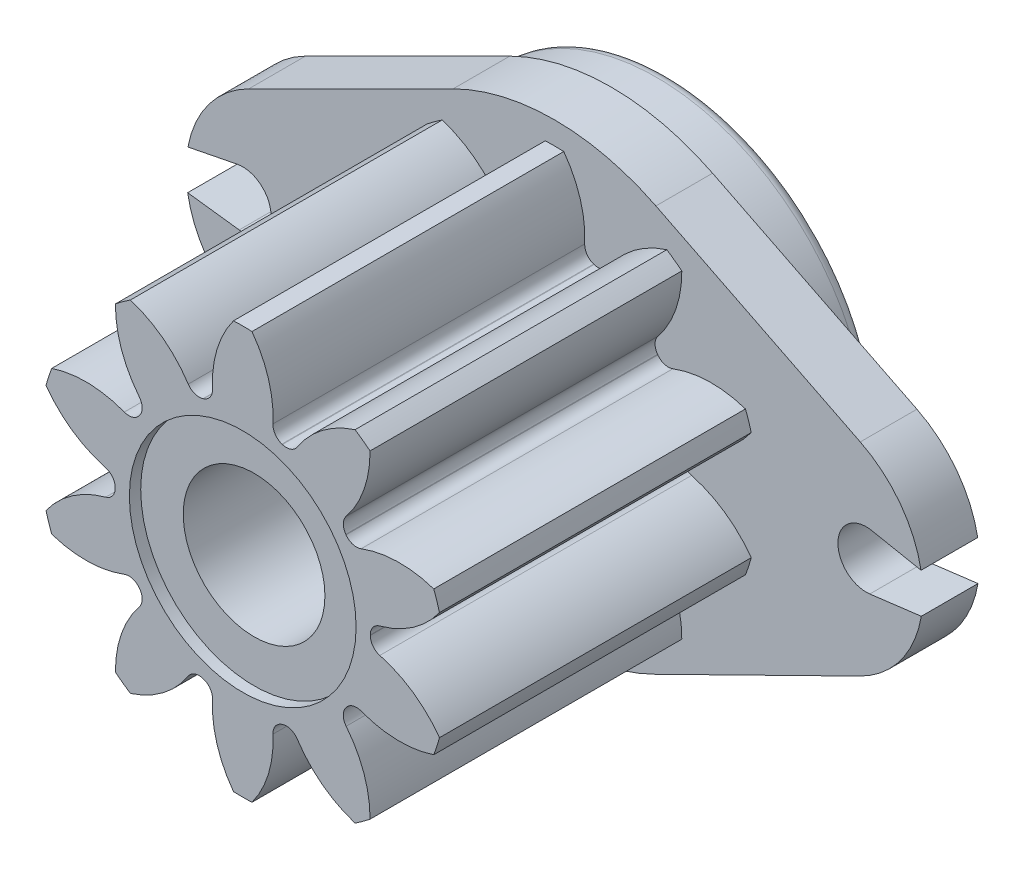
ISO-10303-21;
HEADER;
FILE_DESCRIPTION(('STEP AP214'),'2;1');
FILE_NAME('part.step','',(''),(''),'','','');
FILE_SCHEMA(('AUTOMOTIVE_DESIGN { 1 0 10303 214 1 1 1 1 }'));
ENDSEC;
DATA;
#1=APPLICATION_CONTEXT('core data for automotive mechanical design processes');
#2=APPLICATION_PROTOCOL_DEFINITION('international standard','automotive_design',2000,#1);
#3=PRODUCT_CONTEXT('',#1,'mechanical');
#4=PRODUCT('Part','Part','',(#3));
#5=PRODUCT_RELATED_PRODUCT_CATEGORY('part','',(#4));
#6=PRODUCT_DEFINITION_FORMATION('','',#4);
#7=PRODUCT_DEFINITION_CONTEXT('part definition',#1,'design');
#8=PRODUCT_DEFINITION('design','',#6,#7);
#9=PRODUCT_DEFINITION_SHAPE('','',#8);
#10=(LENGTH_UNIT() NAMED_UNIT(*) SI_UNIT(.MILLI.,.METRE.));
#11=(NAMED_UNIT(*) PLANE_ANGLE_UNIT() SI_UNIT($,.RADIAN.));
#12=(NAMED_UNIT(*) SI_UNIT($,.STERADIAN.) SOLID_ANGLE_UNIT());
#13=UNCERTAINTY_MEASURE_WITH_UNIT(LENGTH_MEASURE(1.E-05),#10,'distance_accuracy_value','');
#14=(GEOMETRIC_REPRESENTATION_CONTEXT(3) GLOBAL_UNCERTAINTY_ASSIGNED_CONTEXT((#13)) GLOBAL_UNIT_ASSIGNED_CONTEXT((#10,
#11,#12)) REPRESENTATION_CONTEXT('',''));
#15=CARTESIAN_POINT('',(0.,0.,0.));
#16=DIRECTION('',(0.,0.,1.));
#17=DIRECTION('',(1.,0.,0.));
#18=AXIS2_PLACEMENT_3D('',#15,#16,#17);
#19=CARTESIAN_POINT('',(0.,0.,0.));
#20=DIRECTION('',(0.,0.,1.));
#21=DIRECTION('',(1.,0.,0.));
#22=AXIS2_PLACEMENT_3D('',#19,#20,#21);
#23=CYLINDRICAL_SURFACE('',#22,1.25);
#24=CARTESIAN_POINT('',(0.,0.,0.));
#25=DIRECTION('',(0.,0.,1.));
#26=DIRECTION('',(1.,0.,0.));
#27=AXIS2_PLACEMENT_3D('',#24,#25,#26);
#28=CIRCLE('',#27,1.25);
#29=CARTESIAN_POINT('',(1.25,0.,0.));
#30=VERTEX_POINT('',#29);
#31=EDGE_CURVE('E718',#30,#30,#28,.T.);
#32=ORIENTED_EDGE('',*,*,#31,.F.);
#33=EDGE_LOOP('',(#32));
#34=FACE_BOUND('',#33,.T.);
#35=CARTESIAN_POINT('',(0.,0.,7.3));
#36=DIRECTION('',(0.,0.,1.));
#37=DIRECTION('',(1.,0.,0.));
#38=AXIS2_PLACEMENT_3D('',#35,#36,#37);
#39=CIRCLE('',#38,1.25);
#40=CARTESIAN_POINT('',(1.25,0.,7.3));
#41=VERTEX_POINT('',#40);
#42=EDGE_CURVE('E516',#41,#41,#39,.F.);
#43=ORIENTED_EDGE('',*,*,#42,.F.);
#44=EDGE_LOOP('',(#43));
#45=FACE_BOUND('',#44,.T.);
#46=ADVANCED_FACE('F29',(#34,#45),#23,.F.);
#47=CARTESIAN_POINT('',(4.4999784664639,-0.0139212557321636,2.));
#48=DIRECTION('',(0.,0.,1.));
#49=DIRECTION('',(1.,0.,0.));
#50=AXIS2_PLACEMENT_3D('',#47,#48,#49);
#51=PLANE('',#50);
#52=CARTESIAN_POINT('',(4.4999784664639,-0.0139212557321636,2.));
#53=DIRECTION('',(0.,0.,1.));
#54=DIRECTION('',(1.,0.,0.));
#55=AXIS2_PLACEMENT_3D('',#52,#53,#54);
#56=CIRCLE('',#55,2.);
#57=CARTESIAN_POINT('',(5.38332054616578,-1.80827539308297,2.));
#58=VERTEX_POINT('',#57);
#59=CARTESIAN_POINT('',(6.47153903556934,-0.35,2.));
#60=VERTEX_POINT('',#59);
#61=EDGE_CURVE('E764',#58,#60,#56,.T.);
#62=ORIENTED_EDGE('',*,*,#61,.T.);
#63=DIRECTION('',(-0.992177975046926,-0.124831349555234,0.));
#64=VECTOR('',#63,1.);
#65=CARTESIAN_POINT('',(6.47153903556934,-0.35,2.));
#66=LINE('',#65,#64);
#67=CARTESIAN_POINT('',(5.56241567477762,-0.464381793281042,2.));
#68=VERTEX_POINT('',#67);
#69=EDGE_CURVE('E767',#60,#68,#66,.T.);
#70=ORIENTED_EDGE('',*,*,#69,.T.);
#71=CARTESIAN_POINT('',(5.5,0.0317071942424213,2.));
#72=DIRECTION('',(0.,0.,-1.));
#73=DIRECTION('',(1.,0.,0.));
#74=AXIS2_PLACEMENT_3D('',#71,#72,#73);
#75=CIRCLE('',#74,0.5);
#76=CARTESIAN_POINT('',(5.59713047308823,0.5221821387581,2.));
#77=VERTEX_POINT('',#76);
#78=EDGE_CURVE('E769',#68,#77,#75,.T.);
#79=ORIENTED_EDGE('',*,*,#78,.T.);
#80=DIRECTION('',(0.980949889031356,-0.194260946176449,0.));
#81=VECTOR('',#80,1.);
#82=CARTESIAN_POINT('',(6.46659010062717,0.35,2.));
#83=LINE('',#82,#81);
#84=CARTESIAN_POINT('',(6.46659010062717,0.35,2.));
#85=VERTEX_POINT('',#84);
#86=EDGE_CURVE('E771',#77,#85,#83,.T.);
#87=ORIENTED_EDGE('',*,*,#86,.T.);
#88=CARTESIAN_POINT('',(4.4999784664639,-0.0139212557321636,2.));
#89=DIRECTION('',(0.,0.,1.));
#90=DIRECTION('',(1.,0.,0.));
#91=AXIS2_PLACEMENT_3D('',#88,#89,#90);
#92=CIRCLE('',#91,2.);
#93=CARTESIAN_POINT('',(5.39440565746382,1.77493312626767,2.));
#94=VERTEX_POINT('',#93);
#95=EDGE_CURVE('E773',#85,#94,#92,.T.);
#96=ORIENTED_EDGE('',*,*,#95,.T.);
#97=DIRECTION('',(-0.894427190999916,0.447213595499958,0.));
#98=VECTOR('',#97,1.);
#99=CARTESIAN_POINT('',(5.39440565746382,1.77493312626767,2.));
#100=LINE('',#99,#98);
#101=CARTESIAN_POINT('',(1.78885438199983,3.57770876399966,2.));
#102=VERTEX_POINT('',#101);
#103=EDGE_CURVE('E775',#94,#102,#100,.T.);
#104=ORIENTED_EDGE('',*,*,#103,.T.);
#105=CARTESIAN_POINT('',(0.,0.,2.));
#106=DIRECTION('',(0.,0.,1.));
#107=DIRECTION('',(1.,0.,0.));
#108=AXIS2_PLACEMENT_3D('',#105,#106,#107);
#109=CIRCLE('',#108,4.);
#110=CARTESIAN_POINT('',(-1.78885438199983,3.57770876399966,2.));
#111=VERTEX_POINT('',#110);
#112=EDGE_CURVE('E777',#102,#111,#109,.T.);
#113=ORIENTED_EDGE('',*,*,#112,.T.);
#114=DIRECTION('',(-0.894427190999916,-0.447213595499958,0.));
#115=VECTOR('',#114,1.);
#116=CARTESIAN_POINT('',(-5.39440565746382,1.77493312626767,2.));
#117=LINE('',#116,#115);
#118=CARTESIAN_POINT('',(-5.39440565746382,1.77493312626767,2.));
#119=VERTEX_POINT('',#118);
#120=EDGE_CURVE('E779',#111,#119,#117,.T.);
#121=ORIENTED_EDGE('',*,*,#120,.T.);
#122=CARTESIAN_POINT('',(-4.4999784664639,-0.0139212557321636,2.));
#123=DIRECTION('',(0.,0.,1.));
#124=DIRECTION('',(-1.,0.,0.));
#125=AXIS2_PLACEMENT_3D('',#122,#123,#124);
#126=CIRCLE('',#125,2.);
#127=CARTESIAN_POINT('',(-6.46659010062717,0.35,2.));
#128=VERTEX_POINT('',#127);
#129=EDGE_CURVE('E781',#119,#128,#126,.T.);
#130=ORIENTED_EDGE('',*,*,#129,.T.);
#131=DIRECTION('',(0.980949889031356,0.194260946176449,0.));
#132=VECTOR('',#131,1.);
#133=CARTESIAN_POINT('',(-6.46659010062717,0.35,2.));
#134=LINE('',#133,#132);
#135=CARTESIAN_POINT('',(-5.59713047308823,0.5221821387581,2.));
#136=VERTEX_POINT('',#135);
#137=EDGE_CURVE('E783',#128,#136,#134,.T.);
#138=ORIENTED_EDGE('',*,*,#137,.T.);
#139=CARTESIAN_POINT('',(-5.5,0.0317071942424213,2.));
#140=DIRECTION('',(0.,0.,-1.));
#141=DIRECTION('',(-1.,0.,0.));
#142=AXIS2_PLACEMENT_3D('',#139,#140,#141);
#143=CIRCLE('',#142,0.5);
#144=CARTESIAN_POINT('',(-5.56241567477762,-0.464381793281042,2.));
#145=VERTEX_POINT('',#144);
#146=EDGE_CURVE('E785',#136,#145,#143,.T.);
#147=ORIENTED_EDGE('',*,*,#146,.T.);
#148=DIRECTION('',(-0.992177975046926,0.124831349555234,0.));
#149=VECTOR('',#148,1.);
#150=CARTESIAN_POINT('',(-6.47153903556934,-0.35,2.));
#151=LINE('',#150,#149);
#152=CARTESIAN_POINT('',(-6.47153903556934,-0.35,2.));
#153=VERTEX_POINT('',#152);
#154=EDGE_CURVE('E787',#145,#153,#151,.T.);
#155=ORIENTED_EDGE('',*,*,#154,.T.);
#156=CARTESIAN_POINT('',(-4.4999784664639,-0.0139212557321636,2.));
#157=DIRECTION('',(0.,0.,1.));
#158=DIRECTION('',(-1.,0.,0.));
#159=AXIS2_PLACEMENT_3D('',#156,#157,#158);
#160=CIRCLE('',#159,2.);
#161=CARTESIAN_POINT('',(-5.38332054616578,-1.80827539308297,2.));
#162=VERTEX_POINT('',#161);
#163=EDGE_CURVE('E789',#153,#162,#160,.T.);
#164=ORIENTED_EDGE('',*,*,#163,.T.);
#165=DIRECTION('',(0.897177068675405,-0.441671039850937,0.));
#166=VECTOR('',#165,1.);
#167=CARTESIAN_POINT('',(-5.38332054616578,-1.80827539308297,2.));
#168=LINE('',#167,#166);
#169=CARTESIAN_POINT('',(-1.76668415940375,-3.58870827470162,2.));
#170=VERTEX_POINT('',#169);
#171=EDGE_CURVE('E791',#162,#170,#168,.T.);
#172=ORIENTED_EDGE('',*,*,#171,.T.);
#173=CARTESIAN_POINT('',(0.,0.,2.));
#174=DIRECTION('',(0.,0.,1.));
#175=DIRECTION('',(1.,0.,0.));
#176=AXIS2_PLACEMENT_3D('',#173,#174,#175);
#177=CIRCLE('',#176,4.);
#178=CARTESIAN_POINT('',(1.76668415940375,-3.58870827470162,2.));
#179=VERTEX_POINT('',#178);
#180=EDGE_CURVE('E793',#170,#179,#177,.T.);
#181=ORIENTED_EDGE('',*,*,#180,.T.);
#182=DIRECTION('',(0.897177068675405,0.441671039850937,0.));
#183=VECTOR('',#182,1.);
#184=CARTESIAN_POINT('',(5.38332054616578,-1.80827539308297,2.));
#185=LINE('',#184,#183);
#186=EDGE_CURVE('E795',#179,#58,#185,.T.);
#187=ORIENTED_EDGE('',*,*,#186,.T.);
#188=EDGE_LOOP('',(#62,#70,#79,#87,#96,#104,#113,#121,#130,#138,#147,#155,#164,#172,#181,#187));
#189=FACE_BOUND('',#188,.T.);
#190=CARTESIAN_POINT('',(0.343106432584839,2.79812057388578,2.));
#191=DIRECTION('',(0.,0.,1.));
#192=DIRECTION('',(0.809016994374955,-0.587785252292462,0.));
#193=AXIS2_PLACEMENT_3D('',#190,#191,#192);
#194=CIRCLE('',#193,1.903100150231);
#195=CARTESIAN_POINT('',(1.82450713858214,1.6034481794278,2.));
#196=VERTEX_POINT('',#195);
#197=CARTESIAN_POINT('',(2.24614580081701,2.81333059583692,2.));
#198=VERTEX_POINT('',#197);
#199=EDGE_CURVE('E505',#196,#198,#194,.T.);
#200=ORIENTED_EDGE('',*,*,#199,.F.);
#201=CARTESIAN_POINT('',(2.00198563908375,1.46032102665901,2.));
#202=DIRECTION('',(0.,0.,1.));
#203=DIRECTION('',(1.,0.,0.));
#204=AXIS2_PLACEMENT_3D('',#201,#202,#203);
#205=CIRCLE('',#204,0.228);
#206=CARTESIAN_POINT('',(1.81778357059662,1.32595734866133,2.));
#207=VERTEX_POINT('',#206);
#208=EDGE_CURVE('E1015',#196,#207,#205,.T.);
#209=ORIENTED_EDGE('',*,*,#208,.T.);
#210=CARTESIAN_POINT('',(0.,0.,2.));
#211=DIRECTION('',(0.,0.,1.));
#212=DIRECTION('',(1.,0.,0.));
#213=AXIS2_PLACEMENT_3D('',#210,#211,#212);
#214=CIRCLE('',#213,2.25);
#215=CARTESIAN_POINT('',(1.8227863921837,1.31907155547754,2.));
#216=VERTEX_POINT('',#215);
#217=EDGE_CURVE('E1963',#216,#207,#214,.T.);
#218=ORIENTED_EDGE('',*,*,#217,.F.);
#219=CARTESIAN_POINT('',(2.00749541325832,1.45273747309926,2.));
#220=DIRECTION('',(0.,0.,1.));
#221=DIRECTION('',(1.,0.,0.));
#222=AXIS2_PLACEMENT_3D('',#219,#220,#221);
#223=CIRCLE('',#222,0.228);
#224=CARTESIAN_POINT('',(2.08877355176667,1.23971666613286,2.));
#225=VERTEX_POINT('',#224);
#226=EDGE_CURVE('E997',#216,#225,#223,.T.);
#227=ORIENTED_EDGE('',*,*,#226,.T.);
#228=CARTESIAN_POINT('',(2.7671965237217,-0.538353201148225,2.));
#229=DIRECTION('',(0.,0.,1.));
#230=DIRECTION('',(0.309016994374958,-0.95105651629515,0.));
#231=AXIS2_PLACEMENT_3D('',#228,#229,#230);
#232=CIRCLE('',#231,1.903100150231);
#233=CARTESIAN_POINT('',(3.36973361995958,1.26684463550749,2.));
#234=VERTEX_POINT('',#233);
#235=EDGE_CURVE('E542',#234,#225,#232,.T.);
#236=ORIENTED_EDGE('',*,*,#235,.F.);
#237=CARTESIAN_POINT('',(0.,0.,2.));
#238=DIRECTION('',(0.,0.,1.));
#239=DIRECTION('',(0.309016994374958,-0.95105651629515,0.));
#240=AXIS2_PLACEMENT_3D('',#237,#238,#239);
#241=CIRCLE('',#240,3.6);
#242=CARTESIAN_POINT('',(3.47080435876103,0.955780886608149,2.));
#243=VERTEX_POINT('',#242);
#244=EDGE_CURVE('E540',#243,#234,#241,.T.);
#245=ORIENTED_EDGE('',*,*,#244,.F.);
#246=CARTESIAN_POINT('',(1.92227294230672,2.06205419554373,2.));
#247=DIRECTION('',(0.,0.,1.));
#248=DIRECTION('',(0.309016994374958,-0.95105651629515,0.));
#249=AXIS2_PLACEMENT_3D('',#246,#247,#248);
#250=CIRCLE('',#249,1.903100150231);
#251=CARTESIAN_POINT('',(2.41854047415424,0.224798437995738,2.));
#252=VERTEX_POINT('',#251);
#253=EDGE_CURVE('E523',#252,#243,#250,.T.);
#254=ORIENTED_EDGE('',*,*,#253,.F.);
#255=CARTESIAN_POINT('',(2.47799556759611,0.00468689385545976,2.));
#256=DIRECTION('',(0.,0.,1.));
#257=DIRECTION('',(1.,0.,0.));
#258=AXIS2_PLACEMENT_3D('',#255,#256,#257);
#259=CIRCLE('',#258,0.228);
#260=CARTESIAN_POINT('',(2.2499959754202,0.00425565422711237,2.));
#261=VERTEX_POINT('',#260);
#262=EDGE_CURVE('E999',#252,#261,#259,.T.);
#263=ORIENTED_EDGE('',*,*,#262,.T.);
#264=CARTESIAN_POINT('',(2.2499959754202,-0.00425565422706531,2.));
#265=VERTEX_POINT('',#264);
#266=EDGE_CURVE('E1965',#265,#261,#214,.T.);
#267=ORIENTED_EDGE('',*,*,#266,.F.);
#268=CARTESIAN_POINT('',(2.47799556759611,-0.00468689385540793,2.));
#269=DIRECTION('',(0.,0.,1.));
#270=DIRECTION('',(1.,0.,0.));
#271=AXIS2_PLACEMENT_3D('',#268,#269,#270);
#272=CIRCLE('',#271,0.228);
#273=CARTESIAN_POINT('',(2.41854047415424,-0.224798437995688,2.));
#274=VERTEX_POINT('',#273);
#275=EDGE_CURVE('E979',#265,#274,#272,.T.);
#276=ORIENTED_EDGE('',*,*,#275,.T.);
#277=CARTESIAN_POINT('',(1.92227294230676,-2.06205419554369,2.));
#278=DIRECTION('',(0.,0.,1.));
#279=DIRECTION('',(-0.309016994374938,-0.951056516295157,0.));
#280=AXIS2_PLACEMENT_3D('',#277,#278,#279);
#281=CIRCLE('',#280,1.903100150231);
#282=CARTESIAN_POINT('',(3.47080435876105,-0.955780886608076,2.));
#283=VERTEX_POINT('',#282);
#284=EDGE_CURVE('E562',#283,#274,#281,.T.);
#285=ORIENTED_EDGE('',*,*,#284,.F.);
#286=CARTESIAN_POINT('',(0.,0.,2.));
#287=DIRECTION('',(0.,0.,1.));
#288=DIRECTION('',(-0.309016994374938,-0.951056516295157,0.));
#289=AXIS2_PLACEMENT_3D('',#286,#287,#288);
#290=CIRCLE('',#289,3.6);
#291=CARTESIAN_POINT('',(3.3697336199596,-1.26684463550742,2.));
#292=VERTEX_POINT('',#291);
#293=EDGE_CURVE('E560',#292,#283,#290,.T.);
#294=ORIENTED_EDGE('',*,*,#293,.F.);
#295=CARTESIAN_POINT('',(2.76719652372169,0.538353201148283,2.));
#296=DIRECTION('',(0.,0.,1.));
#297=DIRECTION('',(-0.309016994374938,-0.951056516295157,0.));
#298=AXIS2_PLACEMENT_3D('',#295,#296,#297);
#299=CIRCLE('',#298,1.903100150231);
#300=CARTESIAN_POINT('',(2.0887735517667,-1.23971666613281,2.));
#301=VERTEX_POINT('',#300);
#302=EDGE_CURVE('E558',#301,#292,#299,.T.);
#303=ORIENTED_EDGE('',*,*,#302,.F.);
#304=CARTESIAN_POINT('',(2.00749541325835,-1.45273747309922,2.));
#305=DIRECTION('',(0.,0.,1.));
#306=DIRECTION('',(1.,0.,0.));
#307=AXIS2_PLACEMENT_3D('',#304,#305,#306);
#308=CIRCLE('',#307,0.228);
#309=CARTESIAN_POINT('',(1.82278639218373,-1.3190715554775,2.));
#310=VERTEX_POINT('',#309);
#311=EDGE_CURVE('E981',#301,#310,#308,.T.);
#312=ORIENTED_EDGE('',*,*,#311,.T.);
#313=CARTESIAN_POINT('',(1.81778357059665,-1.32595734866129,2.));
#314=VERTEX_POINT('',#313);
#315=EDGE_CURVE('E1969',#314,#310,#214,.T.);
#316=ORIENTED_EDGE('',*,*,#315,.F.);
#317=CARTESIAN_POINT('',(2.00198563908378,-1.46032102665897,2.));
#318=DIRECTION('',(0.,0.,1.));
#319=DIRECTION('',(1.,0.,0.));
#320=AXIS2_PLACEMENT_3D('',#317,#318,#319);
#321=CIRCLE('',#320,0.228);
#322=CARTESIAN_POINT('',(1.82450713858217,-1.60344817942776,2.));
#323=VERTEX_POINT('',#322);
#324=EDGE_CURVE('E961',#314,#323,#321,.T.);
#325=ORIENTED_EDGE('',*,*,#324,.T.);
#326=CARTESIAN_POINT('',(0.343106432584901,-2.79812057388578,2.));
#327=DIRECTION('',(0.,0.,1.));
#328=DIRECTION('',(-0.809016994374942,-0.58778525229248,0.));
#329=AXIS2_PLACEMENT_3D('',#326,#327,#328);
#330=CIRCLE('',#329,1.903100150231);
#331=CARTESIAN_POINT('',(2.24614580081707,-2.81333059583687,2.));
#332=VERTEX_POINT('',#331);
#333=EDGE_CURVE('E582',#332,#323,#330,.T.);
#334=ORIENTED_EDGE('',*,*,#333,.F.);
#335=CARTESIAN_POINT('',(0.,0.,2.));
#336=DIRECTION('',(0.,0.,1.));
#337=DIRECTION('',(-0.809016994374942,-0.58778525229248,0.));
#338=AXIS2_PLACEMENT_3D('',#335,#336,#337);
#339=CIRCLE('',#338,3.6);
#340=CARTESIAN_POINT('',(1.98153917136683,-3.00557856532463,2.));
#341=VERTEX_POINT('',#340);
#342=EDGE_CURVE('E580',#341,#332,#339,.T.);
#343=ORIENTED_EDGE('',*,*,#342,.F.);
#344=CARTESIAN_POINT('',(2.55514508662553,-1.19098041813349,2.));
#345=DIRECTION('',(0.,0.,1.));
#346=DIRECTION('',(-0.809016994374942,-0.58778525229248,0.));
#347=AXIS2_PLACEMENT_3D('',#344,#345,#346);
#348=CIRCLE('',#347,1.903100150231);
#349=CARTESIAN_POINT('',(0.961166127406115,-2.23070214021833,2.));
#350=VERTEX_POINT('',#349);
#351=EDGE_CURVE('E578',#350,#341,#348,.T.);
#352=ORIENTED_EDGE('',*,*,#351,.F.);
#353=CARTESIAN_POINT('',(0.770200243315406,-2.35526550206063,2.));
#354=DIRECTION('',(0.,0.,1.));
#355=DIRECTION('',(1.,0.,0.));
#356=AXIS2_PLACEMENT_3D('',#353,#354,#355);
#357=CIRCLE('',#356,0.228);
#358=CARTESIAN_POINT('',(0.699334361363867,-2.13855826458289,2.));
#359=VERTEX_POINT('',#358);
#360=EDGE_CURVE('E963',#350,#359,#357,.T.);
#361=ORIENTED_EDGE('',*,*,#360,.T.);
#362=CARTESIAN_POINT('',(0.691239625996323,-2.1411884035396,2.));
#363=VERTEX_POINT('',#362);
#364=EDGE_CURVE('E1973',#363,#359,#214,.T.);
#365=ORIENTED_EDGE('',*,*,#364,.F.);
#366=CARTESIAN_POINT('',(0.761285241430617,-2.35816216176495,2.));
#367=DIRECTION('',(0.,0.,1.));
#368=DIRECTION('',(1.,0.,0.));
#369=AXIS2_PLACEMENT_3D('',#366,#367,#368);
#370=CIRCLE('',#369,0.228);
#371=CARTESIAN_POINT('',(0.533574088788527,-2.36963521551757,2.));
#372=VERTEX_POINT('',#371);
#373=EDGE_CURVE('E943',#363,#372,#370,.T.);
#374=ORIENTED_EDGE('',*,*,#373,.T.);
#375=CARTESIAN_POINT('',(-1.36711507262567,-2.46539999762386,2.));
#376=DIRECTION('',(0.,0.,1.));
#377=DIRECTION('',(-1.,0.,0.));
#378=AXIS2_PLACEMENT_3D('',#375,#376,#377);
#379=CIRCLE('',#378,1.903100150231);
#380=CARTESIAN_POINT('',(0.163535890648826,-3.59628363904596,2.));
#381=VERTEX_POINT('',#380);
#382=EDGE_CURVE('E602',#381,#372,#379,.T.);
#383=ORIENTED_EDGE('',*,*,#382,.F.);
#384=CARTESIAN_POINT('',(0.,0.,2.));
#385=DIRECTION('',(0.,0.,1.));
#386=DIRECTION('',(-1.,0.,0.));
#387=AXIS2_PLACEMENT_3D('',#384,#385,#386);
#388=CIRCLE('',#387,3.6);
#389=CARTESIAN_POINT('',(-0.163535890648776,-3.59628363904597,2.));
#390=VERTEX_POINT('',#389);
#391=EDGE_CURVE('E600',#390,#381,#388,.T.);
#392=ORIENTED_EDGE('',*,*,#391,.F.);
#393=CARTESIAN_POINT('',(1.3671150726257,-2.46539999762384,2.));
#394=DIRECTION('',(0.,0.,1.));
#395=DIRECTION('',(-1.,0.,0.));
#396=AXIS2_PLACEMENT_3D('',#393,#394,#395);
#397=CIRCLE('',#396,1.903100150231);
#398=CARTESIAN_POINT('',(-0.533574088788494,-2.36963521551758,2.));
#399=VERTEX_POINT('',#398);
#400=EDGE_CURVE('E598',#399,#390,#397,.T.);
#401=ORIENTED_EDGE('',*,*,#400,.F.);
#402=CARTESIAN_POINT('',(-0.761285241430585,-2.35816216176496,2.));
#403=DIRECTION('',(0.,0.,1.));
#404=DIRECTION('',(1.,0.,0.));
#405=AXIS2_PLACEMENT_3D('',#402,#403,#404);
#406=CIRCLE('',#405,0.228);
#407=CARTESIAN_POINT('',(-0.691239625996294,-2.14118840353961,2.));
#408=VERTEX_POINT('',#407);
#409=EDGE_CURVE('E945',#399,#408,#406,.T.);
#410=ORIENTED_EDGE('',*,*,#409,.T.);
#411=CARTESIAN_POINT('',(-0.699334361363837,-2.1385582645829,2.));
#412=VERTEX_POINT('',#411);
#413=EDGE_CURVE('E1977',#412,#408,#214,.T.);
#414=ORIENTED_EDGE('',*,*,#413,.F.);
#415=CARTESIAN_POINT('',(-0.770200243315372,-2.35526550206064,2.));
#416=DIRECTION('',(0.,0.,1.));
#417=DIRECTION('',(1.,0.,0.));
#418=AXIS2_PLACEMENT_3D('',#415,#416,#417);
#419=CIRCLE('',#418,0.228);
#420=CARTESIAN_POINT('',(-0.961166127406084,-2.23070214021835,2.));
#421=VERTEX_POINT('',#420);
#422=EDGE_CURVE('E925',#412,#421,#419,.T.);
#423=ORIENTED_EDGE('',*,*,#422,.T.);
#424=CARTESIAN_POINT('',(-2.55514508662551,-1.19098041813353,2.));
#425=DIRECTION('',(0.,0.,1.));
#426=DIRECTION('',(-0.809016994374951,0.587785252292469,0.));
#427=AXIS2_PLACEMENT_3D('',#424,#425,#426);
#428=CIRCLE('',#427,1.903100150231);
#429=CARTESIAN_POINT('',(-1.98153917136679,-3.00557856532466,2.));
#430=VERTEX_POINT('',#429);
#431=EDGE_CURVE('E622',#430,#421,#428,.T.);
#432=ORIENTED_EDGE('',*,*,#431,.F.);
#433=CARTESIAN_POINT('',(0.,0.,2.));
#434=DIRECTION('',(0.,0.,1.));
#435=DIRECTION('',(-0.809016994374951,0.587785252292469,0.));
#436=AXIS2_PLACEMENT_3D('',#433,#434,#435);
#437=CIRCLE('',#436,3.6);
#438=CARTESIAN_POINT('',(-2.24614580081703,-2.8133305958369,2.));
#439=VERTEX_POINT('',#438);
#440=EDGE_CURVE('E620',#439,#430,#437,.T.);
#441=ORIENTED_EDGE('',*,*,#440,.F.);
#442=CARTESIAN_POINT('',(-0.34310643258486,-2.79812057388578,2.));
#443=DIRECTION('',(0.,0.,1.));
#444=DIRECTION('',(-0.809016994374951,0.587785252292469,0.));
#445=AXIS2_PLACEMENT_3D('',#442,#443,#444);
#446=CIRCLE('',#445,1.903100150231);
#447=CARTESIAN_POINT('',(-1.82450713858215,-1.60344817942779,2.));
#448=VERTEX_POINT('',#447);
#449=EDGE_CURVE('E618',#448,#439,#446,.T.);
#450=ORIENTED_EDGE('',*,*,#449,.F.);
#451=CARTESIAN_POINT('',(-2.00198563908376,-1.460321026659,2.));
#452=DIRECTION('',(0.,0.,1.));
#453=DIRECTION('',(1.,0.,0.));
#454=AXIS2_PLACEMENT_3D('',#451,#452,#453);
#455=CIRCLE('',#454,0.228);
#456=CARTESIAN_POINT('',(-1.81778357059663,-1.32595734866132,2.));
#457=VERTEX_POINT('',#456);
#458=EDGE_CURVE('E927',#448,#457,#455,.T.);
#459=ORIENTED_EDGE('',*,*,#458,.T.);
#460=CARTESIAN_POINT('',(-1.82278639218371,-1.31907155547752,2.));
#461=VERTEX_POINT('',#460);
#462=EDGE_CURVE('E1981',#461,#457,#214,.T.);
#463=ORIENTED_EDGE('',*,*,#462,.F.);
#464=CARTESIAN_POINT('',(-2.00749541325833,-1.45273747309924,2.));
#465=DIRECTION('',(0.,0.,1.));
#466=DIRECTION('',(1.,0.,0.));
#467=AXIS2_PLACEMENT_3D('',#464,#465,#466);
#468=CIRCLE('',#467,0.228);
#469=CARTESIAN_POINT('',(-2.08877355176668,-1.23971666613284,2.));
#470=VERTEX_POINT('',#469);
#471=EDGE_CURVE('E907',#461,#470,#468,.T.);
#472=ORIENTED_EDGE('',*,*,#471,.T.);
#473=CARTESIAN_POINT('',(-2.7671965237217,0.538353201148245,2.));
#474=DIRECTION('',(0.,0.,1.));
#475=DIRECTION('',(-0.309016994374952,0.951056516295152,0.));
#476=AXIS2_PLACEMENT_3D('',#473,#474,#475);
#477=CIRCLE('',#476,1.903100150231);
#478=CARTESIAN_POINT('',(-3.36973361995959,-1.26684463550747,2.));
#479=VERTEX_POINT('',#478);
#480=EDGE_CURVE('E642',#479,#470,#477,.T.);
#481=ORIENTED_EDGE('',*,*,#480,.F.);
#482=CARTESIAN_POINT('',(0.,0.,2.));
#483=DIRECTION('',(0.,0.,1.));
#484=DIRECTION('',(-0.309016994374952,0.951056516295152,0.));
#485=AXIS2_PLACEMENT_3D('',#482,#483,#484);
#486=CIRCLE('',#485,3.6);
#487=CARTESIAN_POINT('',(-3.47080435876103,-0.955780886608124,2.));
#488=VERTEX_POINT('',#487);
#489=EDGE_CURVE('E640',#488,#479,#486,.T.);
#490=ORIENTED_EDGE('',*,*,#489,.F.);
#491=CARTESIAN_POINT('',(-1.92227294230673,-2.06205419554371,2.));
#492=DIRECTION('',(0.,0.,1.));
#493=DIRECTION('',(-0.309016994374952,0.951056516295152,0.));
#494=AXIS2_PLACEMENT_3D('',#491,#492,#493);
#495=CIRCLE('',#494,1.903100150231);
#496=CARTESIAN_POINT('',(-2.41854047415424,-0.224798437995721,2.));
#497=VERTEX_POINT('',#496);
#498=EDGE_CURVE('E638',#497,#488,#495,.T.);
#499=ORIENTED_EDGE('',*,*,#498,.F.);
#500=CARTESIAN_POINT('',(-2.47799556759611,-0.00468689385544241,2.));
#501=DIRECTION('',(0.,0.,1.));
#502=DIRECTION('',(1.,0.,0.));
#503=AXIS2_PLACEMENT_3D('',#500,#501,#502);
#504=CIRCLE('',#503,0.228);
#505=CARTESIAN_POINT('',(-2.2499959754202,-0.00425565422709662,2.));
#506=VERTEX_POINT('',#505);
#507=EDGE_CURVE('E909',#497,#506,#504,.T.);
#508=ORIENTED_EDGE('',*,*,#507,.T.);
#509=CARTESIAN_POINT('',(-2.2499959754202,0.00425565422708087,2.));
#510=VERTEX_POINT('',#509);
#511=EDGE_CURVE('E1985',#510,#506,#214,.T.);
#512=ORIENTED_EDGE('',*,*,#511,.F.);
#513=CARTESIAN_POINT('',(-2.47799556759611,0.00468689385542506,2.));
#514=DIRECTION('',(0.,0.,1.));
#515=DIRECTION('',(1.,0.,0.));
#516=AXIS2_PLACEMENT_3D('',#513,#514,#515);
#517=CIRCLE('',#516,0.228);
#518=CARTESIAN_POINT('',(-2.41854047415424,0.224798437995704,2.));
#519=VERTEX_POINT('',#518);
#520=EDGE_CURVE('E889',#510,#519,#517,.T.);
#521=ORIENTED_EDGE('',*,*,#520,.T.);
#522=CARTESIAN_POINT('',(-1.92227294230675,2.0620541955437,2.));
#523=DIRECTION('',(0.,0.,1.));
#524=DIRECTION('',(0.309016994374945,0.951056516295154,0.));
#525=AXIS2_PLACEMENT_3D('',#522,#523,#524);
#526=CIRCLE('',#525,1.903100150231);
#527=CARTESIAN_POINT('',(-3.47080435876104,0.955780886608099,2.));
#528=VERTEX_POINT('',#527);
#529=EDGE_CURVE('E662',#528,#519,#526,.T.);
#530=ORIENTED_EDGE('',*,*,#529,.F.);
#531=CARTESIAN_POINT('',(0.,0.,2.));
#532=DIRECTION('',(0.,0.,1.));
#533=DIRECTION('',(0.309016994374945,0.951056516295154,0.));
#534=AXIS2_PLACEMENT_3D('',#531,#532,#533);
#535=CIRCLE('',#534,3.6);
#536=CARTESIAN_POINT('',(-3.36973361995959,1.26684463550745,2.));
#537=VERTEX_POINT('',#536);
#538=EDGE_CURVE('E660',#537,#528,#535,.T.);
#539=ORIENTED_EDGE('',*,*,#538,.F.);
#540=CARTESIAN_POINT('',(-2.76719652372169,-0.538353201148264,2.));
#541=DIRECTION('',(0.,0.,1.));
#542=DIRECTION('',(0.309016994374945,0.951056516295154,0.));
#543=AXIS2_PLACEMENT_3D('',#540,#541,#542);
#544=CIRCLE('',#543,1.903100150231);
#545=CARTESIAN_POINT('',(-2.08877355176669,1.23971666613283,2.));
#546=VERTEX_POINT('',#545);
#547=EDGE_CURVE('E658',#546,#537,#544,.T.);
#548=ORIENTED_EDGE('',*,*,#547,.F.);
#549=CARTESIAN_POINT('',(-2.00749541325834,1.45273747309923,2.));
#550=DIRECTION('',(0.,0.,1.));
#551=DIRECTION('',(1.,0.,0.));
#552=AXIS2_PLACEMENT_3D('',#549,#550,#551);
#553=CIRCLE('',#552,0.228);
#554=CARTESIAN_POINT('',(-1.82278639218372,1.31907155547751,2.));
#555=VERTEX_POINT('',#554);
#556=EDGE_CURVE('E891',#546,#555,#553,.T.);
#557=ORIENTED_EDGE('',*,*,#556,.T.);
#558=CARTESIAN_POINT('',(-1.81778357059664,1.32595734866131,2.));
#559=VERTEX_POINT('',#558);
#560=EDGE_CURVE('E726',#559,#555,#214,.T.);
#561=ORIENTED_EDGE('',*,*,#560,.F.);
#562=CARTESIAN_POINT('',(-2.00198563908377,1.46032102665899,2.));
#563=DIRECTION('',(0.,0.,1.));
#564=DIRECTION('',(1.,0.,0.));
#565=AXIS2_PLACEMENT_3D('',#562,#563,#564);
#566=CIRCLE('',#565,0.228);
#567=CARTESIAN_POINT('',(-1.82450713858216,1.60344817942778,2.));
#568=VERTEX_POINT('',#567);
#569=EDGE_CURVE('E871',#559,#568,#566,.T.);
#570=ORIENTED_EDGE('',*,*,#569,.T.);
#571=CARTESIAN_POINT('',(-0.34310643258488,2.79812057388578,2.));
#572=DIRECTION('',(0.,0.,1.));
#573=DIRECTION('',(0.809016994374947,0.587785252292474,0.));
#574=AXIS2_PLACEMENT_3D('',#571,#572,#573);
#575=CIRCLE('',#574,1.903100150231);
#576=CARTESIAN_POINT('',(-2.24614580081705,2.81333059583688,2.));
#577=VERTEX_POINT('',#576);
#578=EDGE_CURVE('E682',#577,#568,#575,.T.);
#579=ORIENTED_EDGE('',*,*,#578,.F.);
#580=CARTESIAN_POINT('',(0.,0.,2.));
#581=DIRECTION('',(0.,0.,1.));
#582=DIRECTION('',(0.809016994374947,0.587785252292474,0.));
#583=AXIS2_PLACEMENT_3D('',#580,#581,#582);
#584=CIRCLE('',#583,3.6);
#585=CARTESIAN_POINT('',(-1.98153917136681,3.00557856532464,2.));
#586=VERTEX_POINT('',#585);
#587=EDGE_CURVE('E680',#586,#577,#584,.T.);
#588=ORIENTED_EDGE('',*,*,#587,.F.);
#589=CARTESIAN_POINT('',(-2.55514508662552,1.19098041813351,2.));
#590=DIRECTION('',(0.,0.,1.));
#591=DIRECTION('',(0.809016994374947,0.587785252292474,0.));
#592=AXIS2_PLACEMENT_3D('',#589,#590,#591);
#593=CIRCLE('',#592,1.903100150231);
#594=CARTESIAN_POINT('',(-0.961166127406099,2.23070214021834,2.));
#595=VERTEX_POINT('',#594);
#596=EDGE_CURVE('E678',#595,#586,#593,.T.);
#597=ORIENTED_EDGE('',*,*,#596,.F.);
#598=CARTESIAN_POINT('',(-0.770200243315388,2.35526550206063,2.));
#599=DIRECTION('',(0.,0.,1.));
#600=DIRECTION('',(1.,0.,0.));
#601=AXIS2_PLACEMENT_3D('',#598,#599,#600);
#602=CIRCLE('',#601,0.228);
#603=CARTESIAN_POINT('',(-0.699334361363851,2.1385582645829,2.));
#604=VERTEX_POINT('',#603);
#605=EDGE_CURVE('E873',#595,#604,#602,.T.);
#606=ORIENTED_EDGE('',*,*,#605,.T.);
#607=CARTESIAN_POINT('',(-0.691239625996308,2.1411884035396,2.));
#608=VERTEX_POINT('',#607);
#609=EDGE_CURVE('E722',#608,#604,#214,.T.);
#610=ORIENTED_EDGE('',*,*,#609,.F.);
#611=CARTESIAN_POINT('',(-0.761285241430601,2.35816216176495,2.));
#612=DIRECTION('',(0.,0.,1.));
#613=DIRECTION('',(1.,0.,0.));
#614=AXIS2_PLACEMENT_3D('',#611,#612,#613);
#615=CIRCLE('',#614,0.228);
#616=CARTESIAN_POINT('',(-0.53357408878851,2.36963521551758,2.));
#617=VERTEX_POINT('',#616);
#618=EDGE_CURVE('E851',#608,#617,#615,.T.);
#619=ORIENTED_EDGE('',*,*,#618,.T.);
#620=CARTESIAN_POINT('',(1.36711507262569,2.46539999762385,2.));
#621=DIRECTION('',(0.,0.,1.));
#622=DIRECTION('',(1.,0.,0.));
#623=AXIS2_PLACEMENT_3D('',#620,#621,#622);
#624=CIRCLE('',#623,1.903100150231);
#625=CARTESIAN_POINT('',(-0.163535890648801,3.59628363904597,2.));
#626=VERTEX_POINT('',#625);
#627=EDGE_CURVE('E702',#626,#617,#624,.T.);
#628=ORIENTED_EDGE('',*,*,#627,.F.);
#629=CARTESIAN_POINT('',(0.,0.,2.));
#630=DIRECTION('',(0.,0.,1.));
#631=DIRECTION('',(1.,0.,0.));
#632=AXIS2_PLACEMENT_3D('',#629,#630,#631);
#633=CIRCLE('',#632,3.6);
#634=CARTESIAN_POINT('',(0.163535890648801,3.59628363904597,2.));
#635=VERTEX_POINT('',#634);
#636=EDGE_CURVE('E700',#635,#626,#633,.T.);
#637=ORIENTED_EDGE('',*,*,#636,.F.);
#638=CARTESIAN_POINT('',(-1.36711507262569,2.46539999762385,2.));
#639=DIRECTION('',(0.,0.,1.));
#640=DIRECTION('',(1.,0.,0.));
#641=AXIS2_PLACEMENT_3D('',#638,#639,#640);
#642=CIRCLE('',#641,1.903100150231);
#643=CARTESIAN_POINT('',(0.533574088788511,2.36963521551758,2.));
#644=VERTEX_POINT('',#643);
#645=EDGE_CURVE('E698',#644,#635,#642,.T.);
#646=ORIENTED_EDGE('',*,*,#645,.F.);
#647=CARTESIAN_POINT('',(0.761285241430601,2.35816216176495,2.));
#648=DIRECTION('',(0.,0.,1.));
#649=DIRECTION('',(1.,0.,0.));
#650=AXIS2_PLACEMENT_3D('',#647,#648,#649);
#651=CIRCLE('',#650,0.228);
#652=CARTESIAN_POINT('',(0.691239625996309,2.1411884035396,2.));
#653=VERTEX_POINT('',#652);
#654=EDGE_CURVE('E853',#644,#653,#651,.T.);
#655=ORIENTED_EDGE('',*,*,#654,.T.);
#656=CARTESIAN_POINT('',(0.69933436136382,2.13855826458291,2.));
#657=VERTEX_POINT('',#656);
#658=EDGE_CURVE('E721',#657,#653,#214,.T.);
#659=ORIENTED_EDGE('',*,*,#658,.F.);
#660=CARTESIAN_POINT('',(0.770200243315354,2.35526550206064,2.));
#661=DIRECTION('',(0.,0.,1.));
#662=DIRECTION('',(1.,0.,0.));
#663=AXIS2_PLACEMENT_3D('',#660,#661,#662);
#664=CIRCLE('',#663,0.228);
#665=CARTESIAN_POINT('',(0.961166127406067,2.23070214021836,2.));
#666=VERTEX_POINT('',#665);
#667=EDGE_CURVE('E1013',#657,#666,#664,.T.);
#668=ORIENTED_EDGE('',*,*,#667,.T.);
#669=CARTESIAN_POINT('',(2.5551450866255,1.19098041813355,2.));
#670=DIRECTION('',(0.,0.,1.));
#671=DIRECTION('',(0.809016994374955,-0.587785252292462,0.));
#672=AXIS2_PLACEMENT_3D('',#669,#670,#671);
#673=CIRCLE('',#672,1.903100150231);
#674=CARTESIAN_POINT('',(1.98153917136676,3.00557856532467,2.));
#675=VERTEX_POINT('',#674);
#676=EDGE_CURVE('E528',#675,#666,#673,.T.);
#677=ORIENTED_EDGE('',*,*,#676,.F.);
#678=CARTESIAN_POINT('',(0.,0.,2.));
#679=DIRECTION('',(0.,0.,1.));
#680=DIRECTION('',(0.809016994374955,-0.587785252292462,0.));
#681=AXIS2_PLACEMENT_3D('',#678,#679,#680);
#682=CIRCLE('',#681,3.6);
#683=EDGE_CURVE('E515',#198,#675,#682,.T.);
#684=ORIENTED_EDGE('',*,*,#683,.F.);
#685=EDGE_LOOP('',(#200,#209,#218,#227,#236,#245,#254,#263,#267,#276,#285,#294,#303,#312,#316,
#325,#334,#343,#352,#361,#365,#374,#383,#392,#401,#410,#414,#423,#432,#441,#450,#459,#463,#472,
#481,#490,#499,#508,#512,#521,#530,#539,#548,#557,#561,#570,#579,#588,#597,#606,#610,#619,#628,
#637,#646,#655,#659,#668,#677,#684));
#686=FACE_BOUND('',#685,.T.);
#687=ADVANCED_FACE('F527',(#189,#686),#51,.T.);
#688=CARTESIAN_POINT('',(0.,0.,7.5));
#689=DIRECTION('',(0.,0.,-1.));
#690=DIRECTION('',(-1.,0.,0.));
#691=AXIS2_PLACEMENT_3D('',#688,#689,#690);
#692=CYLINDRICAL_SURFACE('',#691,2.25);
#693=ORIENTED_EDGE('',*,*,#217,.T.);
#694=DIRECTION('',(0.,0.,-1.));
#695=VECTOR('',#694,1.);
#696=CARTESIAN_POINT('',(1.81778357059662,1.32595734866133,7.5));
#697=LINE('',#696,#695);
#698=CARTESIAN_POINT('',(1.81778357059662,1.32595734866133,7.5));
#699=VERTEX_POINT('',#698);
#700=EDGE_CURVE('E1017',#207,#699,#697,.F.);
#701=ORIENTED_EDGE('',*,*,#700,.T.);
#702=CARTESIAN_POINT('',(0.,0.,7.5));
#703=DIRECTION('',(0.,0.,1.));
#704=DIRECTION('',(1.,0.,0.));
#705=AXIS2_PLACEMENT_3D('',#702,#703,#704);
#706=CIRCLE('',#705,2.25);
#707=CARTESIAN_POINT('',(1.8227863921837,1.31907155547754,7.5));
#708=VERTEX_POINT('',#707);
#709=EDGE_CURVE('E1956',#708,#699,#706,.T.);
#710=ORIENTED_EDGE('',*,*,#709,.F.);
#711=DIRECTION('',(0.,0.,-1.));
#712=VECTOR('',#711,1.);
#713=CARTESIAN_POINT('',(1.8227863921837,1.31907155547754,7.5));
#714=LINE('',#713,#712);
#715=EDGE_CURVE('E1003',#708,#216,#714,.T.);
#716=ORIENTED_EDGE('',*,*,#715,.T.);
#717=EDGE_LOOP('',(#693,#701,#710,#716));
#718=FACE_BOUND('',#717,.T.);
#719=ADVANCED_FACE('F1052',(#718),#692,.T.);
#720=CARTESIAN_POINT('',(0.69933436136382,2.13855826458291,7.5));
#721=VERTEX_POINT('',#720);
#722=CARTESIAN_POINT('',(0.691239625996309,2.1411884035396,7.5));
#723=VERTEX_POINT('',#722);
#724=EDGE_CURVE('E725',#721,#723,#706,.T.);
#725=ORIENTED_EDGE('',*,*,#724,.F.);
#726=DIRECTION('',(0.,0.,-1.));
#727=VECTOR('',#726,1.);
#728=CARTESIAN_POINT('',(0.69933436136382,2.13855826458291,7.5));
#729=LINE('',#728,#727);
#730=EDGE_CURVE('E1019',#721,#657,#729,.T.);
#731=ORIENTED_EDGE('',*,*,#730,.T.);
#732=ORIENTED_EDGE('',*,*,#658,.T.);
#733=DIRECTION('',(0.,0.,-1.));
#734=VECTOR('',#733,1.);
#735=CARTESIAN_POINT('',(0.691239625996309,2.14118840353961,7.5));
#736=LINE('',#735,#734);
#737=EDGE_CURVE('E859',#653,#723,#736,.F.);
#738=ORIENTED_EDGE('',*,*,#737,.T.);
#739=EDGE_LOOP('',(#725,#731,#732,#738));
#740=FACE_BOUND('',#739,.T.);
#741=ADVANCED_FACE('F1198',(#740),#692,.T.);
#742=ORIENTED_EDGE('',*,*,#266,.T.);
#743=DIRECTION('',(0.,0.,-1.));
#744=VECTOR('',#743,1.);
#745=CARTESIAN_POINT('',(2.2499959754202,0.00425565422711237,7.5));
#746=LINE('',#745,#744);
#747=CARTESIAN_POINT('',(2.2499959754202,0.00425565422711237,7.5));
#748=VERTEX_POINT('',#747);
#749=EDGE_CURVE('E1001',#261,#748,#746,.F.);
#750=ORIENTED_EDGE('',*,*,#749,.T.);
#751=CARTESIAN_POINT('',(2.2499959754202,-0.00425565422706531,7.5));
#752=VERTEX_POINT('',#751);
#753=EDGE_CURVE('E1952',#752,#748,#706,.T.);
#754=ORIENTED_EDGE('',*,*,#753,.F.);
#755=DIRECTION('',(0.,0.,-1.));
#756=VECTOR('',#755,1.);
#757=CARTESIAN_POINT('',(2.2499959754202,-0.00425565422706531,7.5));
#758=LINE('',#757,#756);
#759=EDGE_CURVE('E985',#752,#265,#758,.T.);
#760=ORIENTED_EDGE('',*,*,#759,.T.);
#761=EDGE_LOOP('',(#742,#750,#754,#760));
#762=FACE_BOUND('',#761,.T.);
#763=ADVANCED_FACE('F1191',(#762),#692,.T.);
#764=ORIENTED_EDGE('',*,*,#315,.T.);
#765=DIRECTION('',(0.,0.,-1.));
#766=VECTOR('',#765,1.);
#767=CARTESIAN_POINT('',(1.82278639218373,-1.3190715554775,7.5));
#768=LINE('',#767,#766);
#769=CARTESIAN_POINT('',(1.82278639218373,-1.3190715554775,7.5));
#770=VERTEX_POINT('',#769);
#771=EDGE_CURVE('E983',#310,#770,#768,.F.);
#772=ORIENTED_EDGE('',*,*,#771,.T.);
#773=CARTESIAN_POINT('',(1.81778357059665,-1.32595734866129,7.5));
#774=VERTEX_POINT('',#773);
#775=EDGE_CURVE('E1948',#774,#770,#706,.T.);
#776=ORIENTED_EDGE('',*,*,#775,.F.);
#777=DIRECTION('',(0.,0.,-1.));
#778=VECTOR('',#777,1.);
#779=CARTESIAN_POINT('',(1.81778357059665,-1.32595734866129,7.5));
#780=LINE('',#779,#778);
#781=EDGE_CURVE('E967',#774,#314,#780,.T.);
#782=ORIENTED_EDGE('',*,*,#781,.T.);
#783=EDGE_LOOP('',(#764,#772,#776,#782));
#784=FACE_BOUND('',#783,.T.);
#785=ADVANCED_FACE('F1184',(#784),#692,.T.);
#786=ORIENTED_EDGE('',*,*,#364,.T.);
#787=DIRECTION('',(0.,0.,-1.));
#788=VECTOR('',#787,1.);
#789=CARTESIAN_POINT('',(0.699334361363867,-2.13855826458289,7.5));
#790=LINE('',#789,#788);
#791=CARTESIAN_POINT('',(0.699334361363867,-2.13855826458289,7.5));
#792=VERTEX_POINT('',#791);
#793=EDGE_CURVE('E965',#359,#792,#790,.F.);
#794=ORIENTED_EDGE('',*,*,#793,.T.);
#795=CARTESIAN_POINT('',(0.691239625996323,-2.1411884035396,7.5));
#796=VERTEX_POINT('',#795);
#797=EDGE_CURVE('E1944',#796,#792,#706,.T.);
#798=ORIENTED_EDGE('',*,*,#797,.F.);
#799=DIRECTION('',(0.,0.,-1.));
#800=VECTOR('',#799,1.);
#801=CARTESIAN_POINT('',(0.691239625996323,-2.1411884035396,7.5));
#802=LINE('',#801,#800);
#803=EDGE_CURVE('E949',#796,#363,#802,.T.);
#804=ORIENTED_EDGE('',*,*,#803,.T.);
#805=EDGE_LOOP('',(#786,#794,#798,#804));
#806=FACE_BOUND('',#805,.T.);
#807=ADVANCED_FACE('F1177',(#806),#692,.T.);
#808=ORIENTED_EDGE('',*,*,#413,.T.);
#809=DIRECTION('',(0.,0.,-1.));
#810=VECTOR('',#809,1.);
#811=CARTESIAN_POINT('',(-0.691239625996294,-2.14118840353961,7.5));
#812=LINE('',#811,#810);
#813=CARTESIAN_POINT('',(-0.691239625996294,-2.14118840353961,7.5));
#814=VERTEX_POINT('',#813);
#815=EDGE_CURVE('E947',#408,#814,#812,.F.);
#816=ORIENTED_EDGE('',*,*,#815,.T.);
#817=CARTESIAN_POINT('',(-0.699334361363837,-2.1385582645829,7.5));
#818=VERTEX_POINT('',#817);
#819=EDGE_CURVE('E1940',#818,#814,#706,.T.);
#820=ORIENTED_EDGE('',*,*,#819,.F.);
#821=DIRECTION('',(0.,0.,-1.));
#822=VECTOR('',#821,1.);
#823=CARTESIAN_POINT('',(-0.699334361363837,-2.1385582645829,7.5));
#824=LINE('',#823,#822);
#825=EDGE_CURVE('E931',#818,#412,#824,.T.);
#826=ORIENTED_EDGE('',*,*,#825,.T.);
#827=EDGE_LOOP('',(#808,#816,#820,#826));
#828=FACE_BOUND('',#827,.T.);
#829=ADVANCED_FACE('F1170',(#828),#692,.T.);
#830=ORIENTED_EDGE('',*,*,#462,.T.);
#831=DIRECTION('',(0.,0.,-1.));
#832=VECTOR('',#831,1.);
#833=CARTESIAN_POINT('',(-1.81778357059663,-1.32595734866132,7.5));
#834=LINE('',#833,#832);
#835=CARTESIAN_POINT('',(-1.81778357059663,-1.32595734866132,7.5));
#836=VERTEX_POINT('',#835);
#837=EDGE_CURVE('E929',#457,#836,#834,.F.);
#838=ORIENTED_EDGE('',*,*,#837,.T.);
#839=CARTESIAN_POINT('',(-1.82278639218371,-1.31907155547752,7.5));
#840=VERTEX_POINT('',#839);
#841=EDGE_CURVE('E1936',#840,#836,#706,.T.);
#842=ORIENTED_EDGE('',*,*,#841,.F.);
#843=DIRECTION('',(0.,0.,-1.));
#844=VECTOR('',#843,1.);
#845=CARTESIAN_POINT('',(-1.82278639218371,-1.31907155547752,7.5));
#846=LINE('',#845,#844);
#847=EDGE_CURVE('E913',#840,#461,#846,.T.);
#848=ORIENTED_EDGE('',*,*,#847,.T.);
#849=EDGE_LOOP('',(#830,#838,#842,#848));
#850=FACE_BOUND('',#849,.T.);
#851=ADVANCED_FACE('F1163',(#850),#692,.T.);
#852=ORIENTED_EDGE('',*,*,#511,.T.);
#853=DIRECTION('',(0.,0.,-1.));
#854=VECTOR('',#853,1.);
#855=CARTESIAN_POINT('',(-2.2499959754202,-0.00425565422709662,7.5));
#856=LINE('',#855,#854);
#857=CARTESIAN_POINT('',(-2.2499959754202,-0.00425565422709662,7.5));
#858=VERTEX_POINT('',#857);
#859=EDGE_CURVE('E911',#506,#858,#856,.F.);
#860=ORIENTED_EDGE('',*,*,#859,.T.);
#861=CARTESIAN_POINT('',(-2.2499959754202,0.00425565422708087,7.5));
#862=VERTEX_POINT('',#861);
#863=EDGE_CURVE('E1934',#862,#858,#706,.T.);
#864=ORIENTED_EDGE('',*,*,#863,.F.);
#865=DIRECTION('',(0.,0.,-1.));
#866=VECTOR('',#865,1.);
#867=CARTESIAN_POINT('',(-2.2499959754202,0.00425565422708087,7.5));
#868=LINE('',#867,#866);
#869=EDGE_CURVE('E895',#862,#510,#868,.T.);
#870=ORIENTED_EDGE('',*,*,#869,.T.);
#871=EDGE_LOOP('',(#852,#860,#864,#870));
#872=FACE_BOUND('',#871,.T.);
#873=ADVANCED_FACE('F1156',(#872),#692,.T.);
#874=ORIENTED_EDGE('',*,*,#560,.T.);
#875=DIRECTION('',(0.,0.,-1.));
#876=VECTOR('',#875,1.);
#877=CARTESIAN_POINT('',(-1.82278639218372,1.31907155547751,7.5));
#878=LINE('',#877,#876);
#879=CARTESIAN_POINT('',(-1.82278639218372,1.31907155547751,7.5));
#880=VERTEX_POINT('',#879);
#881=EDGE_CURVE('E893',#555,#880,#878,.F.);
#882=ORIENTED_EDGE('',*,*,#881,.T.);
#883=CARTESIAN_POINT('',(-1.81778357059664,1.32595734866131,7.5));
#884=VERTEX_POINT('',#883);
#885=EDGE_CURVE('E731',#884,#880,#706,.T.);
#886=ORIENTED_EDGE('',*,*,#885,.F.);
#887=DIRECTION('',(0.,0.,-1.));
#888=VECTOR('',#887,1.);
#889=CARTESIAN_POINT('',(-1.81778357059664,1.32595734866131,7.5));
#890=LINE('',#889,#888);
#891=EDGE_CURVE('E877',#884,#559,#890,.T.);
#892=ORIENTED_EDGE('',*,*,#891,.T.);
#893=EDGE_LOOP('',(#874,#882,#886,#892));
#894=FACE_BOUND('',#893,.T.);
#895=ADVANCED_FACE('F1069',(#894),#692,.T.);
#896=ORIENTED_EDGE('',*,*,#609,.T.);
#897=DIRECTION('',(0.,0.,-1.));
#898=VECTOR('',#897,1.);
#899=CARTESIAN_POINT('',(-0.699334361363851,2.1385582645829,7.5));
#900=LINE('',#899,#898);
#901=CARTESIAN_POINT('',(-0.699334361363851,2.1385582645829,7.5));
#902=VERTEX_POINT('',#901);
#903=EDGE_CURVE('E875',#604,#902,#900,.F.);
#904=ORIENTED_EDGE('',*,*,#903,.T.);
#905=CARTESIAN_POINT('',(-0.691239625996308,2.1411884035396,7.5));
#906=VERTEX_POINT('',#905);
#907=EDGE_CURVE('E727',#906,#902,#706,.T.);
#908=ORIENTED_EDGE('',*,*,#907,.F.);
#909=DIRECTION('',(0.,0.,-1.));
#910=VECTOR('',#909,1.);
#911=CARTESIAN_POINT('',(-0.691239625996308,2.14118840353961,7.5));
#912=LINE('',#911,#910);
#913=EDGE_CURVE('E856',#906,#608,#912,.T.);
#914=ORIENTED_EDGE('',*,*,#913,.T.);
#915=EDGE_LOOP('',(#896,#904,#908,#914));
#916=FACE_BOUND('',#915,.T.);
#917=ADVANCED_FACE('F1066',(#916),#692,.T.);
#918=CARTESIAN_POINT('',(0.,0.,1.));
#919=DIRECTION('',(0.,0.,-1.));
#920=DIRECTION('',(-1.,0.,0.));
#921=AXIS2_PLACEMENT_3D('',#918,#919,#920);
#922=CYLINDRICAL_SURFACE('',#921,3.75);
#923=CARTESIAN_POINT('',(0.,0.,0.2));
#924=DIRECTION('',(0.,0.,1.));
#925=DIRECTION('',(1.,0.,0.));
#926=AXIS2_PLACEMENT_3D('',#923,#924,#925);
#927=CIRCLE('',#926,3.75);
#928=CARTESIAN_POINT('',(3.75,0.,0.2));
#929=VERTEX_POINT('',#928);
#930=EDGE_CURVE('E37',#929,#929,#927,.T.);
#931=ORIENTED_EDGE('',*,*,#930,.T.);
#932=EDGE_LOOP('',(#931));
#933=FACE_BOUND('',#932,.T.);
#934=CARTESIAN_POINT('',(0.,0.,1.));
#935=DIRECTION('',(0.,0.,1.));
#936=DIRECTION('',(1.,0.,0.));
#937=AXIS2_PLACEMENT_3D('',#934,#935,#936);
#938=CIRCLE('',#937,3.75);
#939=CARTESIAN_POINT('',(3.75,0.,1.));
#940=VERTEX_POINT('',#939);
#941=EDGE_CURVE('E845',#940,#940,#938,.T.);
#942=ORIENTED_EDGE('',*,*,#941,.F.);
#943=EDGE_LOOP('',(#942));
#944=FACE_BOUND('',#943,.T.);
#945=ADVANCED_FACE('F31',(#933,#944),#922,.T.);
#946=CARTESIAN_POINT('',(0.,0.,0.));
#947=DIRECTION('',(0.,0.,1.));
#948=DIRECTION('',(1.,0.,0.));
#949=AXIS2_PLACEMENT_3D('',#946,#947,#948);
#950=PLANE('',#949);
#951=CARTESIAN_POINT('',(0.,0.,0.));
#952=DIRECTION('',(0.,0.,1.));
#953=DIRECTION('',(1.,0.,0.));
#954=AXIS2_PLACEMENT_3D('',#951,#952,#953);
#955=CIRCLE('',#954,3.55);
#956=CARTESIAN_POINT('',(3.55,0.,0.));
#957=VERTEX_POINT('',#956);
#958=EDGE_CURVE('E11',#957,#957,#955,.F.);
#959=ORIENTED_EDGE('',*,*,#958,.T.);
#960=EDGE_LOOP('',(#959));
#961=FACE_BOUND('',#960,.T.);
#962=ORIENTED_EDGE('',*,*,#31,.T.);
#963=EDGE_LOOP('',(#962));
#964=FACE_BOUND('',#963,.T.);
#965=ADVANCED_FACE('F1074',(#961,#964),#950,.F.);
#966=CARTESIAN_POINT('',(4.4999784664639,-0.0139212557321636,1.));
#967=DIRECTION('',(0.,0.,1.));
#968=DIRECTION('',(1.,0.,0.));
#969=AXIS2_PLACEMENT_3D('',#966,#967,#968);
#970=PLANE('',#969);
#971=CARTESIAN_POINT('',(4.4999784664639,-0.0139212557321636,1.));
#972=DIRECTION('',(0.,0.,1.));
#973=DIRECTION('',(1.,0.,0.));
#974=AXIS2_PLACEMENT_3D('',#971,#972,#973);
#975=CIRCLE('',#974,2.);
#976=CARTESIAN_POINT('',(5.38332054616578,-1.80827539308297,1.));
#977=VERTEX_POINT('',#976);
#978=CARTESIAN_POINT('',(6.47153903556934,-0.35,1.));
#979=VERTEX_POINT('',#978);
#980=EDGE_CURVE('E730',#977,#979,#975,.T.);
#981=ORIENTED_EDGE('',*,*,#980,.F.);
#982=DIRECTION('',(0.897177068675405,0.441671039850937,0.));
#983=VECTOR('',#982,1.);
#984=CARTESIAN_POINT('',(5.38332054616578,-1.80827539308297,1.));
#985=LINE('',#984,#983);
#986=CARTESIAN_POINT('',(1.76668415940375,-3.58870827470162,1.));
#987=VERTEX_POINT('',#986);
#988=EDGE_CURVE('E762',#987,#977,#985,.T.);
#989=ORIENTED_EDGE('',*,*,#988,.F.);
#990=CARTESIAN_POINT('',(0.,0.,1.));
#991=DIRECTION('',(0.,0.,1.));
#992=DIRECTION('',(1.,0.,0.));
#993=AXIS2_PLACEMENT_3D('',#990,#991,#992);
#994=CIRCLE('',#993,4.);
#995=CARTESIAN_POINT('',(-1.76668415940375,-3.58870827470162,1.));
#996=VERTEX_POINT('',#995);
#997=EDGE_CURVE('E760',#996,#987,#994,.T.);
#998=ORIENTED_EDGE('',*,*,#997,.F.);
#999=DIRECTION('',(0.897177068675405,-0.441671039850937,0.));
#1000=VECTOR('',#999,1.);
#1001=CARTESIAN_POINT('',(-5.38332054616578,-1.80827539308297,1.));
#1002=LINE('',#1001,#1000);
#1003=CARTESIAN_POINT('',(-5.38332054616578,-1.80827539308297,1.));
#1004=VERTEX_POINT('',#1003);
#1005=EDGE_CURVE('E758',#1004,#996,#1002,.T.);
#1006=ORIENTED_EDGE('',*,*,#1005,.F.);
#1007=CARTESIAN_POINT('',(-4.4999784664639,-0.0139212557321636,1.));
#1008=DIRECTION('',(0.,0.,1.));
#1009=DIRECTION('',(-1.,0.,0.));
#1010=AXIS2_PLACEMENT_3D('',#1007,#1008,#1009);
#1011=CIRCLE('',#1010,2.);
#1012=CARTESIAN_POINT('',(-6.47153903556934,-0.35,1.));
#1013=VERTEX_POINT('',#1012);
#1014=EDGE_CURVE('E756',#1013,#1004,#1011,.T.);
#1015=ORIENTED_EDGE('',*,*,#1014,.F.);
#1016=DIRECTION('',(-0.992177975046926,0.124831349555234,0.));
#1017=VECTOR('',#1016,1.);
#1018=CARTESIAN_POINT('',(-6.47153903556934,-0.35,1.));
#1019=LINE('',#1018,#1017);
#1020=CARTESIAN_POINT('',(-5.56241567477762,-0.464381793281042,1.));
#1021=VERTEX_POINT('',#1020);
#1022=EDGE_CURVE('E754',#1021,#1013,#1019,.T.);
#1023=ORIENTED_EDGE('',*,*,#1022,.F.);
#1024=CARTESIAN_POINT('',(-5.5,0.0317071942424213,1.));
#1025=DIRECTION('',(0.,0.,-1.));
#1026=DIRECTION('',(-1.,0.,0.));
#1027=AXIS2_PLACEMENT_3D('',#1024,#1025,#1026);
#1028=CIRCLE('',#1027,0.5);
#1029=CARTESIAN_POINT('',(-5.59713047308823,0.5221821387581,1.));
#1030=VERTEX_POINT('',#1029);
#1031=EDGE_CURVE('E752',#1030,#1021,#1028,.T.);
#1032=ORIENTED_EDGE('',*,*,#1031,.F.);
#1033=DIRECTION('',(0.980949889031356,0.194260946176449,0.));
#1034=VECTOR('',#1033,1.);
#1035=CARTESIAN_POINT('',(-6.46659010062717,0.35,1.));
#1036=LINE('',#1035,#1034);
#1037=CARTESIAN_POINT('',(-6.46659010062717,0.35,1.));
#1038=VERTEX_POINT('',#1037);
#1039=EDGE_CURVE('E750',#1038,#1030,#1036,.T.);
#1040=ORIENTED_EDGE('',*,*,#1039,.F.);
#1041=CARTESIAN_POINT('',(-4.4999784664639,-0.0139212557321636,1.));
#1042=DIRECTION('',(0.,0.,1.));
#1043=DIRECTION('',(-1.,0.,0.));
#1044=AXIS2_PLACEMENT_3D('',#1041,#1042,#1043);
#1045=CIRCLE('',#1044,2.);
#1046=CARTESIAN_POINT('',(-5.39440565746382,1.77493312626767,1.));
#1047=VERTEX_POINT('',#1046);
#1048=EDGE_CURVE('E748',#1047,#1038,#1045,.T.);
#1049=ORIENTED_EDGE('',*,*,#1048,.F.);
#1050=DIRECTION('',(-0.894427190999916,-0.447213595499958,0.));
#1051=VECTOR('',#1050,1.);
#1052=CARTESIAN_POINT('',(-5.39440565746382,1.77493312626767,1.));
#1053=LINE('',#1052,#1051);
#1054=CARTESIAN_POINT('',(-1.78885438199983,3.57770876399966,1.));
#1055=VERTEX_POINT('',#1054);
#1056=EDGE_CURVE('E746',#1055,#1047,#1053,.T.);
#1057=ORIENTED_EDGE('',*,*,#1056,.F.);
#1058=CARTESIAN_POINT('',(0.,0.,1.));
#1059=DIRECTION('',(0.,0.,1.));
#1060=DIRECTION('',(1.,0.,0.));
#1061=AXIS2_PLACEMENT_3D('',#1058,#1059,#1060);
#1062=CIRCLE('',#1061,4.);
#1063=CARTESIAN_POINT('',(1.78885438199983,3.57770876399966,1.));
#1064=VERTEX_POINT('',#1063);
#1065=EDGE_CURVE('E744',#1064,#1055,#1062,.T.);
#1066=ORIENTED_EDGE('',*,*,#1065,.F.);
#1067=DIRECTION('',(-0.894427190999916,0.447213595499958,0.));
#1068=VECTOR('',#1067,1.);
#1069=CARTESIAN_POINT('',(5.39440565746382,1.77493312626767,1.));
#1070=LINE('',#1069,#1068);
#1071=CARTESIAN_POINT('',(5.39440565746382,1.77493312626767,1.));
#1072=VERTEX_POINT('',#1071);
#1073=EDGE_CURVE('E742',#1072,#1064,#1070,.T.);
#1074=ORIENTED_EDGE('',*,*,#1073,.F.);
#1075=CARTESIAN_POINT('',(4.4999784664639,-0.0139212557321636,1.));
#1076=DIRECTION('',(0.,0.,1.));
#1077=DIRECTION('',(1.,0.,0.));
#1078=AXIS2_PLACEMENT_3D('',#1075,#1076,#1077);
#1079=CIRCLE('',#1078,2.);
#1080=CARTESIAN_POINT('',(6.46659010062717,0.35,1.));
#1081=VERTEX_POINT('',#1080);
#1082=EDGE_CURVE('E740',#1081,#1072,#1079,.T.);
#1083=ORIENTED_EDGE('',*,*,#1082,.F.);
#1084=DIRECTION('',(0.980949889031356,-0.194260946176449,0.));
#1085=VECTOR('',#1084,1.);
#1086=CARTESIAN_POINT('',(6.46659010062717,0.35,1.));
#1087=LINE('',#1086,#1085);
#1088=CARTESIAN_POINT('',(5.59713047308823,0.5221821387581,1.));
#1089=VERTEX_POINT('',#1088);
#1090=EDGE_CURVE('E738',#1089,#1081,#1087,.T.);
#1091=ORIENTED_EDGE('',*,*,#1090,.F.);
#1092=CARTESIAN_POINT('',(5.5,0.0317071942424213,1.));
#1093=DIRECTION('',(0.,0.,-1.));
#1094=DIRECTION('',(1.,0.,0.));
#1095=AXIS2_PLACEMENT_3D('',#1092,#1093,#1094);
#1096=CIRCLE('',#1095,0.5);
#1097=CARTESIAN_POINT('',(5.56241567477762,-0.464381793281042,1.));
#1098=VERTEX_POINT('',#1097);
#1099=EDGE_CURVE('E736',#1098,#1089,#1096,.T.);
#1100=ORIENTED_EDGE('',*,*,#1099,.F.);
#1101=DIRECTION('',(-0.992177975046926,-0.124831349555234,0.));
#1102=VECTOR('',#1101,1.);
#1103=CARTESIAN_POINT('',(6.47153903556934,-0.35,1.));
#1104=LINE('',#1103,#1102);
#1105=EDGE_CURVE('E734',#979,#1098,#1104,.T.);
#1106=ORIENTED_EDGE('',*,*,#1105,.F.);
#1107=EDGE_LOOP('',(#981,#989,#998,#1006,#1015,#1023,#1032,#1040,#1049,#1057,#1066,#1074,#1083,
#1091,#1100,#1106));
#1108=FACE_BOUND('',#1107,.T.);
#1109=ORIENTED_EDGE('',*,*,#941,.T.);
#1110=EDGE_LOOP('',(#1109));
#1111=FACE_BOUND('',#1110,.T.);
#1112=ADVANCED_FACE('F1071',(#1108,#1111),#970,.F.);
#1113=CARTESIAN_POINT('',(4.4999784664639,-0.0139212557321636,2.));
#1114=DIRECTION('',(0.,0.,-1.));
#1115=DIRECTION('',(-1.,0.,0.));
#1116=AXIS2_PLACEMENT_3D('',#1113,#1114,#1115);
#1117=CYLINDRICAL_SURFACE('',#1116,2.);
#1118=ORIENTED_EDGE('',*,*,#980,.T.);
#1119=DIRECTION('',(0.,0.,-1.));
#1120=VECTOR('',#1119,1.);
#1121=CARTESIAN_POINT('',(6.47153903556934,-0.35,2.));
#1122=LINE('',#1121,#1120);
#1123=EDGE_CURVE('E842',#60,#979,#1122,.T.);
#1124=ORIENTED_EDGE('',*,*,#1123,.F.);
#1125=ORIENTED_EDGE('',*,*,#61,.F.);
#1126=DIRECTION('',(0.,0.,-1.));
#1127=VECTOR('',#1126,1.);
#1128=CARTESIAN_POINT('',(5.38332054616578,-1.80827539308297,2.));
#1129=LINE('',#1128,#1127);
#1130=EDGE_CURVE('E797',#58,#977,#1129,.T.);
#1131=ORIENTED_EDGE('',*,*,#1130,.T.);
#1132=EDGE_LOOP('',(#1118,#1124,#1125,#1131));
#1133=FACE_BOUND('',#1132,.T.);
#1134=ADVANCED_FACE('F1073',(#1133),#1117,.T.);
#1135=CARTESIAN_POINT('',(6.47153903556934,-0.35,2.));
#1136=DIRECTION('',(0.124831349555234,-0.992177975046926,0.));
#1137=DIRECTION('',(0.992177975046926,0.124831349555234,0.));
#1138=AXIS2_PLACEMENT_3D('',#1135,#1136,#1137);
#1139=PLANE('',#1138);
#1140=ORIENTED_EDGE('',*,*,#1105,.T.);
#1141=DIRECTION('',(0.,0.,-1.));
#1142=VECTOR('',#1141,1.);
#1143=CARTESIAN_POINT('',(5.56241567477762,-0.464381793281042,2.));
#1144=LINE('',#1143,#1142);
#1145=EDGE_CURVE('E839',#68,#1098,#1144,.T.);
#1146=ORIENTED_EDGE('',*,*,#1145,.F.);
#1147=ORIENTED_EDGE('',*,*,#69,.F.);
#1148=ORIENTED_EDGE('',*,*,#1123,.T.);
#1149=EDGE_LOOP('',(#1140,#1146,#1147,#1148));
#1150=FACE_BOUND('',#1149,.T.);
#1151=ADVANCED_FACE('F1131',(#1150),#1139,.F.);
#1152=CARTESIAN_POINT('',(5.5,0.0317071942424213,2.));
#1153=DIRECTION('',(0.,0.,-1.));
#1154=DIRECTION('',(-1.,0.,0.));
#1155=AXIS2_PLACEMENT_3D('',#1152,#1153,#1154);
#1156=CYLINDRICAL_SURFACE('',#1155,0.5);
#1157=ORIENTED_EDGE('',*,*,#1099,.T.);
#1158=DIRECTION('',(0.,0.,-1.));
#1159=VECTOR('',#1158,1.);
#1160=CARTESIAN_POINT('',(5.59713047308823,0.5221821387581,2.));
#1161=LINE('',#1160,#1159);
#1162=EDGE_CURVE('E836',#77,#1089,#1161,.T.);
#1163=ORIENTED_EDGE('',*,*,#1162,.F.);
#1164=ORIENTED_EDGE('',*,*,#78,.F.);
#1165=ORIENTED_EDGE('',*,*,#1145,.T.);
#1166=EDGE_LOOP('',(#1157,#1163,#1164,#1165));
#1167=FACE_BOUND('',#1166,.T.);
#1168=ADVANCED_FACE('F1127',(#1167),#1156,.F.);
#1169=CARTESIAN_POINT('',(6.46659010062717,0.35,2.));
#1170=DIRECTION('',(0.194260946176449,0.980949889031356,0.));
#1171=DIRECTION('',(-0.980949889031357,0.19426094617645,0.));
#1172=AXIS2_PLACEMENT_3D('',#1169,#1170,#1171);
#1173=PLANE('',#1172);
#1174=ORIENTED_EDGE('',*,*,#1090,.T.);
#1175=DIRECTION('',(0.,0.,-1.));
#1176=VECTOR('',#1175,1.);
#1177=CARTESIAN_POINT('',(6.46659010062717,0.35,2.));
#1178=LINE('',#1177,#1176);
#1179=EDGE_CURVE('E833',#85,#1081,#1178,.T.);
#1180=ORIENTED_EDGE('',*,*,#1179,.F.);
#1181=ORIENTED_EDGE('',*,*,#86,.F.);
#1182=ORIENTED_EDGE('',*,*,#1162,.T.);
#1183=EDGE_LOOP('',(#1174,#1180,#1181,#1182));
#1184=FACE_BOUND('',#1183,.T.);
#1185=ADVANCED_FACE('F1123',(#1184),#1173,.F.);
#1186=CARTESIAN_POINT('',(4.4999784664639,-0.0139212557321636,2.));
#1187=DIRECTION('',(0.,0.,-1.));
#1188=DIRECTION('',(-1.,0.,0.));
#1189=AXIS2_PLACEMENT_3D('',#1186,#1187,#1188);
#1190=CYLINDRICAL_SURFACE('',#1189,2.);
#1191=ORIENTED_EDGE('',*,*,#1082,.T.);
#1192=DIRECTION('',(0.,0.,-1.));
#1193=VECTOR('',#1192,1.);
#1194=CARTESIAN_POINT('',(5.39440565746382,1.77493312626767,2.));
#1195=LINE('',#1194,#1193);
#1196=EDGE_CURVE('E830',#94,#1072,#1195,.T.);
#1197=ORIENTED_EDGE('',*,*,#1196,.F.);
#1198=ORIENTED_EDGE('',*,*,#95,.F.);
#1199=ORIENTED_EDGE('',*,*,#1179,.T.);
#1200=EDGE_LOOP('',(#1191,#1197,#1198,#1199));
#1201=FACE_BOUND('',#1200,.T.);
#1202=ADVANCED_FACE('F1119',(#1201),#1190,.T.);
#1203=CARTESIAN_POINT('',(5.39440565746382,1.77493312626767,2.));
#1204=DIRECTION('',(-0.447213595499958,-0.894427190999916,0.));
#1205=DIRECTION('',(0.894427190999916,-0.447213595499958,0.));
#1206=AXIS2_PLACEMENT_3D('',#1203,#1204,#1205);
#1207=PLANE('',#1206);
#1208=ORIENTED_EDGE('',*,*,#1073,.T.);
#1209=DIRECTION('',(0.,0.,-1.));
#1210=VECTOR('',#1209,1.);
#1211=CARTESIAN_POINT('',(1.78885438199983,3.57770876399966,2.));
#1212=LINE('',#1211,#1210);
#1213=EDGE_CURVE('E827',#102,#1064,#1212,.T.);
#1214=ORIENTED_EDGE('',*,*,#1213,.F.);
#1215=ORIENTED_EDGE('',*,*,#103,.F.);
#1216=ORIENTED_EDGE('',*,*,#1196,.T.);
#1217=EDGE_LOOP('',(#1208,#1214,#1215,#1216));
#1218=FACE_BOUND('',#1217,.T.);
#1219=ADVANCED_FACE('F1115',(#1218),#1207,.F.);
#1220=CARTESIAN_POINT('',(0.,0.,2.));
#1221=DIRECTION('',(0.,0.,-1.));
#1222=DIRECTION('',(-1.,0.,0.));
#1223=AXIS2_PLACEMENT_3D('',#1220,#1221,#1222);
#1224=CYLINDRICAL_SURFACE('',#1223,4.);
#1225=ORIENTED_EDGE('',*,*,#1065,.T.);
#1226=DIRECTION('',(0.,0.,-1.));
#1227=VECTOR('',#1226,1.);
#1228=CARTESIAN_POINT('',(-1.78885438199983,3.57770876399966,2.));
#1229=LINE('',#1228,#1227);
#1230=EDGE_CURVE('E824',#111,#1055,#1229,.T.);
#1231=ORIENTED_EDGE('',*,*,#1230,.F.);
#1232=ORIENTED_EDGE('',*,*,#112,.F.);
#1233=ORIENTED_EDGE('',*,*,#1213,.T.);
#1234=EDGE_LOOP('',(#1225,#1231,#1232,#1233));
#1235=FACE_BOUND('',#1234,.T.);
#1236=ADVANCED_FACE('F1111',(#1235),#1224,.T.);
#1237=CARTESIAN_POINT('',(-5.39440565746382,1.77493312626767,2.));
#1238=DIRECTION('',(0.447213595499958,-0.894427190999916,0.));
#1239=DIRECTION('',(0.894427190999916,0.447213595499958,0.));
#1240=AXIS2_PLACEMENT_3D('',#1237,#1238,#1239);
#1241=PLANE('',#1240);
#1242=ORIENTED_EDGE('',*,*,#1056,.T.);
#1243=DIRECTION('',(0.,0.,-1.));
#1244=VECTOR('',#1243,1.);
#1245=CARTESIAN_POINT('',(-5.39440565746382,1.77493312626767,2.));
#1246=LINE('',#1245,#1244);
#1247=EDGE_CURVE('E821',#119,#1047,#1246,.T.);
#1248=ORIENTED_EDGE('',*,*,#1247,.F.);
#1249=ORIENTED_EDGE('',*,*,#120,.F.);
#1250=ORIENTED_EDGE('',*,*,#1230,.T.);
#1251=EDGE_LOOP('',(#1242,#1248,#1249,#1250));
#1252=FACE_BOUND('',#1251,.T.);
#1253=ADVANCED_FACE('F1107',(#1252),#1241,.F.);
#1254=CARTESIAN_POINT('',(-4.4999784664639,-0.0139212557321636,2.));
#1255=DIRECTION('',(0.,0.,-1.));
#1256=DIRECTION('',(-1.,0.,0.));
#1257=AXIS2_PLACEMENT_3D('',#1254,#1255,#1256);
#1258=CYLINDRICAL_SURFACE('',#1257,2.);
#1259=ORIENTED_EDGE('',*,*,#1048,.T.);
#1260=DIRECTION('',(0.,0.,-1.));
#1261=VECTOR('',#1260,1.);
#1262=CARTESIAN_POINT('',(-6.46659010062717,0.35,2.));
#1263=LINE('',#1262,#1261);
#1264=EDGE_CURVE('E818',#128,#1038,#1263,.T.);
#1265=ORIENTED_EDGE('',*,*,#1264,.F.);
#1266=ORIENTED_EDGE('',*,*,#129,.F.);
#1267=ORIENTED_EDGE('',*,*,#1247,.T.);
#1268=EDGE_LOOP('',(#1259,#1265,#1266,#1267));
#1269=FACE_BOUND('',#1268,.T.);
#1270=ADVANCED_FACE('F1103',(#1269),#1258,.T.);
#1271=CARTESIAN_POINT('',(-6.46659010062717,0.35,2.));
#1272=DIRECTION('',(-0.194260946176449,0.980949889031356,0.));
#1273=DIRECTION('',(-0.980949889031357,-0.19426094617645,0.));
#1274=AXIS2_PLACEMENT_3D('',#1271,#1272,#1273);
#1275=PLANE('',#1274);
#1276=ORIENTED_EDGE('',*,*,#1039,.T.);
#1277=DIRECTION('',(0.,0.,-1.));
#1278=VECTOR('',#1277,1.);
#1279=CARTESIAN_POINT('',(-5.59713047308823,0.5221821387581,2.));
#1280=LINE('',#1279,#1278);
#1281=EDGE_CURVE('E815',#136,#1030,#1280,.T.);
#1282=ORIENTED_EDGE('',*,*,#1281,.F.);
#1283=ORIENTED_EDGE('',*,*,#137,.F.);
#1284=ORIENTED_EDGE('',*,*,#1264,.T.);
#1285=EDGE_LOOP('',(#1276,#1282,#1283,#1284));
#1286=FACE_BOUND('',#1285,.T.);
#1287=ADVANCED_FACE('F1099',(#1286),#1275,.F.);
#1288=CARTESIAN_POINT('',(-5.5,0.0317071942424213,2.));
#1289=DIRECTION('',(0.,0.,-1.));
#1290=DIRECTION('',(-1.,0.,0.));
#1291=AXIS2_PLACEMENT_3D('',#1288,#1289,#1290);
#1292=CYLINDRICAL_SURFACE('',#1291,0.5);
#1293=ORIENTED_EDGE('',*,*,#1031,.T.);
#1294=DIRECTION('',(0.,0.,-1.));
#1295=VECTOR('',#1294,1.);
#1296=CARTESIAN_POINT('',(-5.56241567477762,-0.464381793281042,2.));
#1297=LINE('',#1296,#1295);
#1298=EDGE_CURVE('E812',#145,#1021,#1297,.T.);
#1299=ORIENTED_EDGE('',*,*,#1298,.F.);
#1300=ORIENTED_EDGE('',*,*,#146,.F.);
#1301=ORIENTED_EDGE('',*,*,#1281,.T.);
#1302=EDGE_LOOP('',(#1293,#1299,#1300,#1301));
#1303=FACE_BOUND('',#1302,.T.);
#1304=ADVANCED_FACE('F1095',(#1303),#1292,.F.);
#1305=CARTESIAN_POINT('',(-6.47153903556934,-0.35,2.));
#1306=DIRECTION('',(-0.124831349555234,-0.992177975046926,0.));
#1307=DIRECTION('',(0.992177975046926,-0.124831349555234,0.));
#1308=AXIS2_PLACEMENT_3D('',#1305,#1306,#1307);
#1309=PLANE('',#1308);
#1310=ORIENTED_EDGE('',*,*,#1022,.T.);
#1311=DIRECTION('',(0.,0.,-1.));
#1312=VECTOR('',#1311,1.);
#1313=CARTESIAN_POINT('',(-6.47153903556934,-0.35,2.));
#1314=LINE('',#1313,#1312);
#1315=EDGE_CURVE('E809',#153,#1013,#1314,.T.);
#1316=ORIENTED_EDGE('',*,*,#1315,.F.);
#1317=ORIENTED_EDGE('',*,*,#154,.F.);
#1318=ORIENTED_EDGE('',*,*,#1298,.T.);
#1319=EDGE_LOOP('',(#1310,#1316,#1317,#1318));
#1320=FACE_BOUND('',#1319,.T.);
#1321=ADVANCED_FACE('F1091',(#1320),#1309,.F.);
#1322=CARTESIAN_POINT('',(-4.4999784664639,-0.0139212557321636,2.));
#1323=DIRECTION('',(0.,0.,-1.));
#1324=DIRECTION('',(-1.,0.,0.));
#1325=AXIS2_PLACEMENT_3D('',#1322,#1323,#1324);
#1326=CYLINDRICAL_SURFACE('',#1325,2.);
#1327=ORIENTED_EDGE('',*,*,#1014,.T.);
#1328=DIRECTION('',(0.,0.,-1.));
#1329=VECTOR('',#1328,1.);
#1330=CARTESIAN_POINT('',(-5.38332054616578,-1.80827539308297,2.));
#1331=LINE('',#1330,#1329);
#1332=EDGE_CURVE('E806',#162,#1004,#1331,.T.);
#1333=ORIENTED_EDGE('',*,*,#1332,.F.);
#1334=ORIENTED_EDGE('',*,*,#163,.F.);
#1335=ORIENTED_EDGE('',*,*,#1315,.T.);
#1336=EDGE_LOOP('',(#1327,#1333,#1334,#1335));
#1337=FACE_BOUND('',#1336,.T.);
#1338=ADVANCED_FACE('F1087',(#1337),#1326,.T.);
#1339=CARTESIAN_POINT('',(-5.38332054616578,-1.80827539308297,2.));
#1340=DIRECTION('',(0.441671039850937,0.897177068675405,0.));
#1341=DIRECTION('',(-0.897177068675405,0.441671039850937,0.));
#1342=AXIS2_PLACEMENT_3D('',#1339,#1340,#1341);
#1343=PLANE('',#1342);
#1344=ORIENTED_EDGE('',*,*,#1005,.T.);
#1345=DIRECTION('',(0.,0.,-1.));
#1346=VECTOR('',#1345,1.);
#1347=CARTESIAN_POINT('',(-1.76668415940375,-3.58870827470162,2.));
#1348=LINE('',#1347,#1346);
#1349=EDGE_CURVE('E803',#170,#996,#1348,.T.);
#1350=ORIENTED_EDGE('',*,*,#1349,.F.);
#1351=ORIENTED_EDGE('',*,*,#171,.F.);
#1352=ORIENTED_EDGE('',*,*,#1332,.T.);
#1353=EDGE_LOOP('',(#1344,#1350,#1351,#1352));
#1354=FACE_BOUND('',#1353,.T.);
#1355=ADVANCED_FACE('F1083',(#1354),#1343,.F.);
#1356=CARTESIAN_POINT('',(0.,0.,2.));
#1357=DIRECTION('',(0.,0.,-1.));
#1358=DIRECTION('',(-1.,0.,0.));
#1359=AXIS2_PLACEMENT_3D('',#1356,#1357,#1358);
#1360=CYLINDRICAL_SURFACE('',#1359,4.);
#1361=ORIENTED_EDGE('',*,*,#997,.T.);
#1362=DIRECTION('',(0.,0.,-1.));
#1363=VECTOR('',#1362,1.);
#1364=CARTESIAN_POINT('',(1.76668415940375,-3.58870827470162,2.));
#1365=LINE('',#1364,#1363);
#1366=EDGE_CURVE('E800',#179,#987,#1365,.T.);
#1367=ORIENTED_EDGE('',*,*,#1366,.F.);
#1368=ORIENTED_EDGE('',*,*,#180,.F.);
#1369=ORIENTED_EDGE('',*,*,#1349,.T.);
#1370=EDGE_LOOP('',(#1361,#1367,#1368,#1369));
#1371=FACE_BOUND('',#1370,.T.);
#1372=ADVANCED_FACE('F1079',(#1371),#1360,.T.);
#1373=CARTESIAN_POINT('',(5.38332054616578,-1.80827539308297,2.));
#1374=DIRECTION('',(-0.441671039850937,0.897177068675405,0.));
#1375=DIRECTION('',(-0.897177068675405,-0.441671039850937,0.));
#1376=AXIS2_PLACEMENT_3D('',#1373,#1374,#1375);
#1377=PLANE('',#1376);
#1378=ORIENTED_EDGE('',*,*,#988,.T.);
#1379=ORIENTED_EDGE('',*,*,#1130,.F.);
#1380=ORIENTED_EDGE('',*,*,#186,.F.);
#1381=ORIENTED_EDGE('',*,*,#1366,.T.);
#1382=EDGE_LOOP('',(#1378,#1379,#1380,#1381));
#1383=FACE_BOUND('',#1382,.T.);
#1384=ADVANCED_FACE('F1064',(#1383),#1377,.F.);
#1385=CARTESIAN_POINT('',(0.,0.,7.5));
#1386=DIRECTION('',(0.,0.,1.));
#1387=DIRECTION('',(1.,0.,0.));
#1388=AXIS2_PLACEMENT_3D('',#1385,#1386,#1387);
#1389=PLANE('',#1388);
#1390=CARTESIAN_POINT('',(0.,0.,7.5));
#1391=DIRECTION('',(0.,0.,1.));
#1392=DIRECTION('',(1.,0.,0.));
#1393=AXIS2_PLACEMENT_3D('',#1390,#1391,#1392);
#1394=CIRCLE('',#1393,2.);
#1395=CARTESIAN_POINT('',(2.,0.,7.5));
#1396=VERTEX_POINT('',#1395);
#1397=EDGE_CURVE('E2079',#1396,#1396,#1394,.T.);
#1398=ORIENTED_EDGE('',*,*,#1397,.F.);
#1399=EDGE_LOOP('',(#1398));
#1400=FACE_BOUND('',#1399,.T.);
#1401=CARTESIAN_POINT('',(1.36711507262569,2.46539999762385,7.5));
#1402=DIRECTION('',(0.,0.,1.));
#1403=DIRECTION('',(1.,0.,0.));
#1404=AXIS2_PLACEMENT_3D('',#1401,#1402,#1403);
#1405=CIRCLE('',#1404,1.903100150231);
#1406=CARTESIAN_POINT('',(-0.163535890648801,3.59628363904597,7.5));
#1407=VERTEX_POINT('',#1406);
#1408=CARTESIAN_POINT('',(-0.53357408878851,2.36963521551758,7.5));
#1409=VERTEX_POINT('',#1408);
#1410=EDGE_CURVE('E709',#1407,#1409,#1405,.T.);
#1411=ORIENTED_EDGE('',*,*,#1410,.T.);
#1412=CARTESIAN_POINT('',(-0.761285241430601,2.35816216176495,7.5));
#1413=DIRECTION('',(0.,0.,1.));
#1414=DIRECTION('',(1.,0.,0.));
#1415=AXIS2_PLACEMENT_3D('',#1412,#1413,#1414);
#1416=CIRCLE('',#1415,0.228);
#1417=EDGE_CURVE('E866',#1409,#906,#1416,.F.);
#1418=ORIENTED_EDGE('',*,*,#1417,.T.);
#1419=ORIENTED_EDGE('',*,*,#907,.T.);
#1420=CARTESIAN_POINT('',(-0.770200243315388,2.35526550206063,7.5));
#1421=DIRECTION('',(0.,0.,1.));
#1422=DIRECTION('',(1.,0.,0.));
#1423=AXIS2_PLACEMENT_3D('',#1420,#1421,#1422);
#1424=CIRCLE('',#1423,0.228);
#1425=CARTESIAN_POINT('',(-0.961166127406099,2.23070214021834,7.5));
#1426=VERTEX_POINT('',#1425);
#1427=EDGE_CURVE('E882',#902,#1426,#1424,.F.);
#1428=ORIENTED_EDGE('',*,*,#1427,.T.);
#1429=CARTESIAN_POINT('',(-2.55514508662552,1.19098041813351,7.5));
#1430=DIRECTION('',(0.,0.,1.));
#1431=DIRECTION('',(0.809016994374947,0.587785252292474,0.));
#1432=AXIS2_PLACEMENT_3D('',#1429,#1430,#1431);
#1433=CIRCLE('',#1432,1.903100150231);
#1434=CARTESIAN_POINT('',(-1.98153917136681,3.00557856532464,7.5));
#1435=VERTEX_POINT('',#1434);
#1436=EDGE_CURVE('E685',#1426,#1435,#1433,.T.);
#1437=ORIENTED_EDGE('',*,*,#1436,.T.);
#1438=CARTESIAN_POINT('',(0.,0.,7.5));
#1439=DIRECTION('',(0.,0.,1.));
#1440=DIRECTION('',(0.809016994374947,0.587785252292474,0.));
#1441=AXIS2_PLACEMENT_3D('',#1438,#1439,#1440);
#1442=CIRCLE('',#1441,3.6);
#1443=CARTESIAN_POINT('',(-2.24614580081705,2.81333059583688,7.5));
#1444=VERTEX_POINT('',#1443);
#1445=EDGE_CURVE('E687',#1435,#1444,#1442,.T.);
#1446=ORIENTED_EDGE('',*,*,#1445,.T.);
#1447=CARTESIAN_POINT('',(-0.34310643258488,2.79812057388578,7.5));
#1448=DIRECTION('',(0.,0.,1.));
#1449=DIRECTION('',(0.809016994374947,0.587785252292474,0.));
#1450=AXIS2_PLACEMENT_3D('',#1447,#1448,#1449);
#1451=CIRCLE('',#1450,1.903100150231);
#1452=CARTESIAN_POINT('',(-1.82450713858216,1.60344817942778,7.5));
#1453=VERTEX_POINT('',#1452);
#1454=EDGE_CURVE('E689',#1444,#1453,#1451,.T.);
#1455=ORIENTED_EDGE('',*,*,#1454,.T.);
#1456=CARTESIAN_POINT('',(-2.00198563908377,1.46032102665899,7.5));
#1457=DIRECTION('',(0.,0.,1.));
#1458=DIRECTION('',(1.,0.,0.));
#1459=AXIS2_PLACEMENT_3D('',#1456,#1457,#1458);
#1460=CIRCLE('',#1459,0.228);
#1461=EDGE_CURVE('E884',#1453,#884,#1460,.F.);
#1462=ORIENTED_EDGE('',*,*,#1461,.T.);
#1463=ORIENTED_EDGE('',*,*,#885,.T.);
#1464=CARTESIAN_POINT('',(-2.00749541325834,1.45273747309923,7.5));
#1465=DIRECTION('',(0.,0.,1.));
#1466=DIRECTION('',(1.,0.,0.));
#1467=AXIS2_PLACEMENT_3D('',#1464,#1465,#1466);
#1468=CIRCLE('',#1467,0.228);
#1469=CARTESIAN_POINT('',(-2.08877355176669,1.23971666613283,7.5));
#1470=VERTEX_POINT('',#1469);
#1471=EDGE_CURVE('E900',#880,#1470,#1468,.F.);
#1472=ORIENTED_EDGE('',*,*,#1471,.T.);
#1473=CARTESIAN_POINT('',(-2.76719652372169,-0.538353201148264,7.5));
#1474=DIRECTION('',(0.,0.,1.));
#1475=DIRECTION('',(0.309016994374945,0.951056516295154,0.));
#1476=AXIS2_PLACEMENT_3D('',#1473,#1474,#1475);
#1477=CIRCLE('',#1476,1.903100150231);
#1478=CARTESIAN_POINT('',(-3.36973361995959,1.26684463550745,7.5));
#1479=VERTEX_POINT('',#1478);
#1480=EDGE_CURVE('E665',#1470,#1479,#1477,.T.);
#1481=ORIENTED_EDGE('',*,*,#1480,.T.);
#1482=CARTESIAN_POINT('',(0.,0.,7.5));
#1483=DIRECTION('',(0.,0.,1.));
#1484=DIRECTION('',(0.309016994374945,0.951056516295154,0.));
#1485=AXIS2_PLACEMENT_3D('',#1482,#1483,#1484);
#1486=CIRCLE('',#1485,3.6);
#1487=CARTESIAN_POINT('',(-3.47080435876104,0.955780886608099,7.5));
#1488=VERTEX_POINT('',#1487);
#1489=EDGE_CURVE('E667',#1479,#1488,#1486,.T.);
#1490=ORIENTED_EDGE('',*,*,#1489,.T.);
#1491=CARTESIAN_POINT('',(-1.92227294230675,2.0620541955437,7.5));
#1492=DIRECTION('',(0.,0.,1.));
#1493=DIRECTION('',(0.309016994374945,0.951056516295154,0.));
#1494=AXIS2_PLACEMENT_3D('',#1491,#1492,#1493);
#1495=CIRCLE('',#1494,1.903100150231);
#1496=CARTESIAN_POINT('',(-2.41854047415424,0.224798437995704,7.5));
#1497=VERTEX_POINT('',#1496);
#1498=EDGE_CURVE('E669',#1488,#1497,#1495,.T.);
#1499=ORIENTED_EDGE('',*,*,#1498,.T.);
#1500=CARTESIAN_POINT('',(-2.47799556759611,0.00468689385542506,7.5));
#1501=DIRECTION('',(0.,0.,1.));
#1502=DIRECTION('',(1.,0.,0.));
#1503=AXIS2_PLACEMENT_3D('',#1500,#1501,#1502);
#1504=CIRCLE('',#1503,0.228);
#1505=EDGE_CURVE('E902',#1497,#862,#1504,.F.);
#1506=ORIENTED_EDGE('',*,*,#1505,.T.);
#1507=ORIENTED_EDGE('',*,*,#863,.T.);
#1508=CARTESIAN_POINT('',(-2.47799556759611,-0.00468689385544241,7.5));
#1509=DIRECTION('',(0.,0.,1.));
#1510=DIRECTION('',(1.,0.,0.));
#1511=AXIS2_PLACEMENT_3D('',#1508,#1509,#1510);
#1512=CIRCLE('',#1511,0.228);
#1513=CARTESIAN_POINT('',(-2.41854047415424,-0.224798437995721,7.5));
#1514=VERTEX_POINT('',#1513);
#1515=EDGE_CURVE('E918',#858,#1514,#1512,.F.);
#1516=ORIENTED_EDGE('',*,*,#1515,.T.);
#1517=CARTESIAN_POINT('',(-1.92227294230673,-2.06205419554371,7.5));
#1518=DIRECTION('',(0.,0.,1.));
#1519=DIRECTION('',(-0.309016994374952,0.951056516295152,0.));
#1520=AXIS2_PLACEMENT_3D('',#1517,#1518,#1519);
#1521=CIRCLE('',#1520,1.903100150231);
#1522=CARTESIAN_POINT('',(-3.47080435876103,-0.955780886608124,7.5));
#1523=VERTEX_POINT('',#1522);
#1524=EDGE_CURVE('E645',#1514,#1523,#1521,.T.);
#1525=ORIENTED_EDGE('',*,*,#1524,.T.);
#1526=CARTESIAN_POINT('',(0.,0.,7.5));
#1527=DIRECTION('',(0.,0.,1.));
#1528=DIRECTION('',(-0.309016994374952,0.951056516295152,0.));
#1529=AXIS2_PLACEMENT_3D('',#1526,#1527,#1528);
#1530=CIRCLE('',#1529,3.6);
#1531=CARTESIAN_POINT('',(-3.36973361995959,-1.26684463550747,7.5));
#1532=VERTEX_POINT('',#1531);
#1533=EDGE_CURVE('E647',#1523,#1532,#1530,.T.);
#1534=ORIENTED_EDGE('',*,*,#1533,.T.);
#1535=CARTESIAN_POINT('',(-2.7671965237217,0.538353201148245,7.5));
#1536=DIRECTION('',(0.,0.,1.));
#1537=DIRECTION('',(-0.309016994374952,0.951056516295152,0.));
#1538=AXIS2_PLACEMENT_3D('',#1535,#1536,#1537);
#1539=CIRCLE('',#1538,1.903100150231);
#1540=CARTESIAN_POINT('',(-2.08877355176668,-1.23971666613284,7.5));
#1541=VERTEX_POINT('',#1540);
#1542=EDGE_CURVE('E649',#1532,#1541,#1539,.T.);
#1543=ORIENTED_EDGE('',*,*,#1542,.T.);
#1544=CARTESIAN_POINT('',(-2.00749541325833,-1.45273747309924,7.5));
#1545=DIRECTION('',(0.,0.,1.));
#1546=DIRECTION('',(1.,0.,0.));
#1547=AXIS2_PLACEMENT_3D('',#1544,#1545,#1546);
#1548=CIRCLE('',#1547,0.228);
#1549=EDGE_CURVE('E920',#1541,#840,#1548,.F.);
#1550=ORIENTED_EDGE('',*,*,#1549,.T.);
#1551=ORIENTED_EDGE('',*,*,#841,.T.);
#1552=CARTESIAN_POINT('',(-2.00198563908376,-1.460321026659,7.5));
#1553=DIRECTION('',(0.,0.,1.));
#1554=DIRECTION('',(1.,0.,0.));
#1555=AXIS2_PLACEMENT_3D('',#1552,#1553,#1554);
#1556=CIRCLE('',#1555,0.228);
#1557=CARTESIAN_POINT('',(-1.82450713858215,-1.60344817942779,7.5));
#1558=VERTEX_POINT('',#1557);
#1559=EDGE_CURVE('E936',#836,#1558,#1556,.F.);
#1560=ORIENTED_EDGE('',*,*,#1559,.T.);
#1561=CARTESIAN_POINT('',(-0.34310643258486,-2.79812057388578,7.5));
#1562=DIRECTION('',(0.,0.,1.));
#1563=DIRECTION('',(-0.809016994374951,0.587785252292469,0.));
#1564=AXIS2_PLACEMENT_3D('',#1561,#1562,#1563);
#1565=CIRCLE('',#1564,1.903100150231);
#1566=CARTESIAN_POINT('',(-2.24614580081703,-2.8133305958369,7.5));
#1567=VERTEX_POINT('',#1566);
#1568=EDGE_CURVE('E625',#1558,#1567,#1565,.T.);
#1569=ORIENTED_EDGE('',*,*,#1568,.T.);
#1570=CARTESIAN_POINT('',(0.,0.,7.5));
#1571=DIRECTION('',(0.,0.,1.));
#1572=DIRECTION('',(-0.809016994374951,0.587785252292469,0.));
#1573=AXIS2_PLACEMENT_3D('',#1570,#1571,#1572);
#1574=CIRCLE('',#1573,3.6);
#1575=CARTESIAN_POINT('',(-1.98153917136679,-3.00557856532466,7.5));
#1576=VERTEX_POINT('',#1575);
#1577=EDGE_CURVE('E627',#1567,#1576,#1574,.T.);
#1578=ORIENTED_EDGE('',*,*,#1577,.T.);
#1579=CARTESIAN_POINT('',(-2.55514508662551,-1.19098041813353,7.5));
#1580=DIRECTION('',(0.,0.,1.));
#1581=DIRECTION('',(-0.809016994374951,0.587785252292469,0.));
#1582=AXIS2_PLACEMENT_3D('',#1579,#1580,#1581);
#1583=CIRCLE('',#1582,1.903100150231);
#1584=CARTESIAN_POINT('',(-0.961166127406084,-2.23070214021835,7.5));
#1585=VERTEX_POINT('',#1584);
#1586=EDGE_CURVE('E629',#1576,#1585,#1583,.T.);
#1587=ORIENTED_EDGE('',*,*,#1586,.T.);
#1588=CARTESIAN_POINT('',(-0.770200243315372,-2.35526550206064,7.5));
#1589=DIRECTION('',(0.,0.,1.));
#1590=DIRECTION('',(1.,0.,0.));
#1591=AXIS2_PLACEMENT_3D('',#1588,#1589,#1590);
#1592=CIRCLE('',#1591,0.228);
#1593=EDGE_CURVE('E938',#1585,#818,#1592,.F.);
#1594=ORIENTED_EDGE('',*,*,#1593,.T.);
#1595=ORIENTED_EDGE('',*,*,#819,.T.);
#1596=CARTESIAN_POINT('',(-0.761285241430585,-2.35816216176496,7.5));
#1597=DIRECTION('',(0.,0.,1.));
#1598=DIRECTION('',(1.,0.,0.));
#1599=AXIS2_PLACEMENT_3D('',#1596,#1597,#1598);
#1600=CIRCLE('',#1599,0.228);
#1601=CARTESIAN_POINT('',(-0.533574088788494,-2.36963521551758,7.5));
#1602=VERTEX_POINT('',#1601);
#1603=EDGE_CURVE('E954',#814,#1602,#1600,.F.);
#1604=ORIENTED_EDGE('',*,*,#1603,.T.);
#1605=CARTESIAN_POINT('',(1.3671150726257,-2.46539999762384,7.5));
#1606=DIRECTION('',(0.,0.,1.));
#1607=DIRECTION('',(-1.,0.,0.));
#1608=AXIS2_PLACEMENT_3D('',#1605,#1606,#1607);
#1609=CIRCLE('',#1608,1.903100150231);
#1610=CARTESIAN_POINT('',(-0.163535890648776,-3.59628363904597,7.5));
#1611=VERTEX_POINT('',#1610);
#1612=EDGE_CURVE('E605',#1602,#1611,#1609,.T.);
#1613=ORIENTED_EDGE('',*,*,#1612,.T.);
#1614=CARTESIAN_POINT('',(0.,0.,7.5));
#1615=DIRECTION('',(0.,0.,1.));
#1616=DIRECTION('',(-1.,0.,0.));
#1617=AXIS2_PLACEMENT_3D('',#1614,#1615,#1616);
#1618=CIRCLE('',#1617,3.6);
#1619=CARTESIAN_POINT('',(0.163535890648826,-3.59628363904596,7.5));
#1620=VERTEX_POINT('',#1619);
#1621=EDGE_CURVE('E607',#1611,#1620,#1618,.T.);
#1622=ORIENTED_EDGE('',*,*,#1621,.T.);
#1623=CARTESIAN_POINT('',(-1.36711507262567,-2.46539999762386,7.5));
#1624=DIRECTION('',(0.,0.,1.));
#1625=DIRECTION('',(-1.,0.,0.));
#1626=AXIS2_PLACEMENT_3D('',#1623,#1624,#1625);
#1627=CIRCLE('',#1626,1.903100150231);
#1628=CARTESIAN_POINT('',(0.533574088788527,-2.36963521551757,7.5));
#1629=VERTEX_POINT('',#1628);
#1630=EDGE_CURVE('E609',#1620,#1629,#1627,.T.);
#1631=ORIENTED_EDGE('',*,*,#1630,.T.);
#1632=CARTESIAN_POINT('',(0.761285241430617,-2.35816216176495,7.5));
#1633=DIRECTION('',(0.,0.,1.));
#1634=DIRECTION('',(1.,0.,0.));
#1635=AXIS2_PLACEMENT_3D('',#1632,#1633,#1634);
#1636=CIRCLE('',#1635,0.228);
#1637=EDGE_CURVE('E956',#1629,#796,#1636,.F.);
#1638=ORIENTED_EDGE('',*,*,#1637,.T.);
#1639=ORIENTED_EDGE('',*,*,#797,.T.);
#1640=CARTESIAN_POINT('',(0.770200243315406,-2.35526550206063,7.5));
#1641=DIRECTION('',(0.,0.,1.));
#1642=DIRECTION('',(1.,0.,0.));
#1643=AXIS2_PLACEMENT_3D('',#1640,#1641,#1642);
#1644=CIRCLE('',#1643,0.228);
#1645=CARTESIAN_POINT('',(0.961166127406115,-2.23070214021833,7.5));
#1646=VERTEX_POINT('',#1645);
#1647=EDGE_CURVE('E972',#792,#1646,#1644,.F.);
#1648=ORIENTED_EDGE('',*,*,#1647,.T.);
#1649=CARTESIAN_POINT('',(2.55514508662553,-1.19098041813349,7.5));
#1650=DIRECTION('',(0.,0.,1.));
#1651=DIRECTION('',(-0.809016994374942,-0.58778525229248,0.));
#1652=AXIS2_PLACEMENT_3D('',#1649,#1650,#1651);
#1653=CIRCLE('',#1652,1.903100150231);
#1654=CARTESIAN_POINT('',(1.98153917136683,-3.00557856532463,7.5));
#1655=VERTEX_POINT('',#1654);
#1656=EDGE_CURVE('E585',#1646,#1655,#1653,.T.);
#1657=ORIENTED_EDGE('',*,*,#1656,.T.);
#1658=CARTESIAN_POINT('',(0.,0.,7.5));
#1659=DIRECTION('',(0.,0.,1.));
#1660=DIRECTION('',(-0.809016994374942,-0.58778525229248,0.));
#1661=AXIS2_PLACEMENT_3D('',#1658,#1659,#1660);
#1662=CIRCLE('',#1661,3.6);
#1663=CARTESIAN_POINT('',(2.24614580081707,-2.81333059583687,7.5));
#1664=VERTEX_POINT('',#1663);
#1665=EDGE_CURVE('E587',#1655,#1664,#1662,.T.);
#1666=ORIENTED_EDGE('',*,*,#1665,.T.);
#1667=CARTESIAN_POINT('',(0.343106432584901,-2.79812057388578,7.5));
#1668=DIRECTION('',(0.,0.,1.));
#1669=DIRECTION('',(-0.809016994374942,-0.58778525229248,0.));
#1670=AXIS2_PLACEMENT_3D('',#1667,#1668,#1669);
#1671=CIRCLE('',#1670,1.903100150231);
#1672=CARTESIAN_POINT('',(1.82450713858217,-1.60344817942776,7.5));
#1673=VERTEX_POINT('',#1672);
#1674=EDGE_CURVE('E589',#1664,#1673,#1671,.T.);
#1675=ORIENTED_EDGE('',*,*,#1674,.T.);
#1676=CARTESIAN_POINT('',(2.00198563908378,-1.46032102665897,7.5));
#1677=DIRECTION('',(0.,0.,1.));
#1678=DIRECTION('',(1.,0.,0.));
#1679=AXIS2_PLACEMENT_3D('',#1676,#1677,#1678);
#1680=CIRCLE('',#1679,0.228);
#1681=EDGE_CURVE('E974',#1673,#774,#1680,.F.);
#1682=ORIENTED_EDGE('',*,*,#1681,.T.);
#1683=ORIENTED_EDGE('',*,*,#775,.T.);
#1684=CARTESIAN_POINT('',(2.00749541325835,-1.45273747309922,7.5));
#1685=DIRECTION('',(0.,0.,1.));
#1686=DIRECTION('',(1.,0.,0.));
#1687=AXIS2_PLACEMENT_3D('',#1684,#1685,#1686);
#1688=CIRCLE('',#1687,0.228);
#1689=CARTESIAN_POINT('',(2.0887735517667,-1.23971666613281,7.5));
#1690=VERTEX_POINT('',#1689);
#1691=EDGE_CURVE('E990',#770,#1690,#1688,.F.);
#1692=ORIENTED_EDGE('',*,*,#1691,.T.);
#1693=CARTESIAN_POINT('',(2.76719652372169,0.538353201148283,7.5));
#1694=DIRECTION('',(0.,0.,1.));
#1695=DIRECTION('',(-0.309016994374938,-0.951056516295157,0.));
#1696=AXIS2_PLACEMENT_3D('',#1693,#1694,#1695);
#1697=CIRCLE('',#1696,1.903100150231);
#1698=CARTESIAN_POINT('',(3.3697336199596,-1.26684463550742,7.5));
#1699=VERTEX_POINT('',#1698);
#1700=EDGE_CURVE('E565',#1690,#1699,#1697,.T.);
#1701=ORIENTED_EDGE('',*,*,#1700,.T.);
#1702=CARTESIAN_POINT('',(0.,0.,7.5));
#1703=DIRECTION('',(0.,0.,1.));
#1704=DIRECTION('',(-0.309016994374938,-0.951056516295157,0.));
#1705=AXIS2_PLACEMENT_3D('',#1702,#1703,#1704);
#1706=CIRCLE('',#1705,3.6);
#1707=CARTESIAN_POINT('',(3.47080435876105,-0.955780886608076,7.5));
#1708=VERTEX_POINT('',#1707);
#1709=EDGE_CURVE('E567',#1699,#1708,#1706,.T.);
#1710=ORIENTED_EDGE('',*,*,#1709,.T.);
#1711=CARTESIAN_POINT('',(1.92227294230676,-2.06205419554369,7.5));
#1712=DIRECTION('',(0.,0.,1.));
#1713=DIRECTION('',(-0.309016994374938,-0.951056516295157,0.));
#1714=AXIS2_PLACEMENT_3D('',#1711,#1712,#1713);
#1715=CIRCLE('',#1714,1.903100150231);
#1716=CARTESIAN_POINT('',(2.41854047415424,-0.224798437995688,7.5));
#1717=VERTEX_POINT('',#1716);
#1718=EDGE_CURVE('E569',#1708,#1717,#1715,.T.);
#1719=ORIENTED_EDGE('',*,*,#1718,.T.);
#1720=CARTESIAN_POINT('',(2.47799556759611,-0.00468689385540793,7.5));
#1721=DIRECTION('',(0.,0.,1.));
#1722=DIRECTION('',(1.,0.,0.));
#1723=AXIS2_PLACEMENT_3D('',#1720,#1721,#1722);
#1724=CIRCLE('',#1723,0.228);
#1725=EDGE_CURVE('E992',#1717,#752,#1724,.F.);
#1726=ORIENTED_EDGE('',*,*,#1725,.T.);
#1727=ORIENTED_EDGE('',*,*,#753,.T.);
#1728=CARTESIAN_POINT('',(2.47799556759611,0.00468689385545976,7.5));
#1729=DIRECTION('',(0.,0.,1.));
#1730=DIRECTION('',(1.,0.,0.));
#1731=AXIS2_PLACEMENT_3D('',#1728,#1729,#1730);
#1732=CIRCLE('',#1731,0.228);
#1733=CARTESIAN_POINT('',(2.41854047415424,0.224798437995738,7.5));
#1734=VERTEX_POINT('',#1733);
#1735=EDGE_CURVE('E1008',#748,#1734,#1732,.F.);
#1736=ORIENTED_EDGE('',*,*,#1735,.T.);
#1737=CARTESIAN_POINT('',(1.92227294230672,2.06205419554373,7.5));
#1738=DIRECTION('',(0.,0.,1.));
#1739=DIRECTION('',(0.309016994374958,-0.95105651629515,0.));
#1740=AXIS2_PLACEMENT_3D('',#1737,#1738,#1739);
#1741=CIRCLE('',#1740,1.903100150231);
#1742=CARTESIAN_POINT('',(3.47080435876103,0.955780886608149,7.5));
#1743=VERTEX_POINT('',#1742);
#1744=EDGE_CURVE('E545',#1734,#1743,#1741,.T.);
#1745=ORIENTED_EDGE('',*,*,#1744,.T.);
#1746=CARTESIAN_POINT('',(0.,0.,7.5));
#1747=DIRECTION('',(0.,0.,1.));
#1748=DIRECTION('',(0.309016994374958,-0.95105651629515,0.));
#1749=AXIS2_PLACEMENT_3D('',#1746,#1747,#1748);
#1750=CIRCLE('',#1749,3.6);
#1751=CARTESIAN_POINT('',(3.36973361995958,1.26684463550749,7.5));
#1752=VERTEX_POINT('',#1751);
#1753=EDGE_CURVE('E547',#1743,#1752,#1750,.T.);
#1754=ORIENTED_EDGE('',*,*,#1753,.T.);
#1755=CARTESIAN_POINT('',(2.7671965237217,-0.538353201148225,7.5));
#1756=DIRECTION('',(0.,0.,1.));
#1757=DIRECTION('',(0.309016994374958,-0.95105651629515,0.));
#1758=AXIS2_PLACEMENT_3D('',#1755,#1756,#1757);
#1759=CIRCLE('',#1758,1.903100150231);
#1760=CARTESIAN_POINT('',(2.08877355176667,1.23971666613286,7.5));
#1761=VERTEX_POINT('',#1760);
#1762=EDGE_CURVE('E549',#1752,#1761,#1759,.T.);
#1763=ORIENTED_EDGE('',*,*,#1762,.T.);
#1764=CARTESIAN_POINT('',(2.00749541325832,1.45273747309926,7.5));
#1765=DIRECTION('',(0.,0.,1.));
#1766=DIRECTION('',(1.,0.,0.));
#1767=AXIS2_PLACEMENT_3D('',#1764,#1765,#1766);
#1768=CIRCLE('',#1767,0.228);
#1769=EDGE_CURVE('E1010',#1761,#708,#1768,.F.);
#1770=ORIENTED_EDGE('',*,*,#1769,.T.);
#1771=ORIENTED_EDGE('',*,*,#709,.T.);
#1772=CARTESIAN_POINT('',(2.00198563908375,1.46032102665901,7.5));
#1773=DIRECTION('',(0.,0.,1.));
#1774=DIRECTION('',(1.,0.,0.));
#1775=AXIS2_PLACEMENT_3D('',#1772,#1773,#1774);
#1776=CIRCLE('',#1775,0.228);
#1777=CARTESIAN_POINT('',(1.82450713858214,1.6034481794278,7.5));
#1778=VERTEX_POINT('',#1777);
#1779=EDGE_CURVE('E1023',#699,#1778,#1776,.F.);
#1780=ORIENTED_EDGE('',*,*,#1779,.T.);
#1781=CARTESIAN_POINT('',(0.343106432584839,2.79812057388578,7.5));
#1782=DIRECTION('',(0.,0.,1.));
#1783=DIRECTION('',(0.809016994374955,-0.587785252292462,0.));
#1784=AXIS2_PLACEMENT_3D('',#1781,#1782,#1783);
#1785=CIRCLE('',#1784,1.903100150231);
#1786=CARTESIAN_POINT('',(2.24614580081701,2.81333059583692,7.5));
#1787=VERTEX_POINT('',#1786);
#1788=EDGE_CURVE('E530',#1778,#1787,#1785,.T.);
#1789=ORIENTED_EDGE('',*,*,#1788,.T.);
#1790=CARTESIAN_POINT('',(0.,0.,7.5));
#1791=DIRECTION('',(0.,0.,1.));
#1792=DIRECTION('',(0.809016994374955,-0.587785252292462,0.));
#1793=AXIS2_PLACEMENT_3D('',#1790,#1791,#1792);
#1794=CIRCLE('',#1793,3.6);
#1795=CARTESIAN_POINT('',(1.98153917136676,3.00557856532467,7.5));
#1796=VERTEX_POINT('',#1795);
#1797=EDGE_CURVE('E522',#1787,#1796,#1794,.T.);
#1798=ORIENTED_EDGE('',*,*,#1797,.T.);
#1799=CARTESIAN_POINT('',(2.5551450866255,1.19098041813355,7.5));
#1800=DIRECTION('',(0.,0.,1.));
#1801=DIRECTION('',(0.809016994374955,-0.587785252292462,0.));
#1802=AXIS2_PLACEMENT_3D('',#1799,#1800,#1801);
#1803=CIRCLE('',#1802,1.903100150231);
#1804=CARTESIAN_POINT('',(0.961166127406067,2.23070214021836,7.5));
#1805=VERTEX_POINT('',#1804);
#1806=EDGE_CURVE('E536',#1796,#1805,#1803,.T.);
#1807=ORIENTED_EDGE('',*,*,#1806,.T.);
#1808=CARTESIAN_POINT('',(0.770200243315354,2.35526550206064,7.5));
#1809=DIRECTION('',(0.,0.,1.));
#1810=DIRECTION('',(1.,0.,0.));
#1811=AXIS2_PLACEMENT_3D('',#1808,#1809,#1810);
#1812=CIRCLE('',#1811,0.228);
#1813=EDGE_CURVE('E51',#1805,#721,#1812,.F.);
#1814=ORIENTED_EDGE('',*,*,#1813,.T.);
#1815=ORIENTED_EDGE('',*,*,#724,.T.);
#1816=CARTESIAN_POINT('',(0.761285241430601,2.35816216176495,7.5));
#1817=DIRECTION('',(0.,0.,1.));
#1818=DIRECTION('',(1.,0.,0.));
#1819=AXIS2_PLACEMENT_3D('',#1816,#1817,#1818);
#1820=CIRCLE('',#1819,0.228);
#1821=CARTESIAN_POINT('',(0.533574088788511,2.36963521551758,7.5));
#1822=VERTEX_POINT('',#1821);
#1823=EDGE_CURVE('E864',#723,#1822,#1820,.F.);
#1824=ORIENTED_EDGE('',*,*,#1823,.T.);
#1825=CARTESIAN_POINT('',(-1.36711507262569,2.46539999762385,7.5));
#1826=DIRECTION('',(0.,0.,1.));
#1827=DIRECTION('',(1.,0.,0.));
#1828=AXIS2_PLACEMENT_3D('',#1825,#1826,#1827);
#1829=CIRCLE('',#1828,1.903100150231);
#1830=CARTESIAN_POINT('',(0.163535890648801,3.59628363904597,7.5));
#1831=VERTEX_POINT('',#1830);
#1832=EDGE_CURVE('E705',#1822,#1831,#1829,.T.);
#1833=ORIENTED_EDGE('',*,*,#1832,.T.);
#1834=CARTESIAN_POINT('',(0.,0.,7.5));
#1835=DIRECTION('',(0.,0.,1.));
#1836=DIRECTION('',(1.,0.,0.));
#1837=AXIS2_PLACEMENT_3D('',#1834,#1835,#1836);
#1838=CIRCLE('',#1837,3.6);
#1839=EDGE_CURVE('E707',#1831,#1407,#1838,.T.);
#1840=ORIENTED_EDGE('',*,*,#1839,.T.);
#1841=EDGE_LOOP('',(#1411,#1418,#1419,#1428,#1437,#1446,#1455,#1462,#1463,#1472,#1481,#1490,
#1499,#1506,#1507,#1516,#1525,#1534,#1543,#1550,#1551,#1560,#1569,#1578,#1587,#1594,#1595,#1604,
#1613,#1622,#1631,#1638,#1639,#1648,#1657,#1666,#1675,#1682,#1683,#1692,#1701,#1710,#1719,#1726,
#1727,#1736,#1745,#1754,#1763,#1770,#1771,#1780,#1789,#1798,#1807,#1814,#1815,#1824,#1833,#1840));
#1842=FACE_BOUND('',#1841,.T.);
#1843=ADVANCED_FACE('F1061',(#1400,#1842),#1389,.T.);
#1844=CARTESIAN_POINT('',(-1.36711507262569,2.46539999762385,7.5));
#1845=DIRECTION('',(0.,0.,-1.));
#1846=DIRECTION('',(-1.,0.,0.));
#1847=AXIS2_PLACEMENT_3D('',#1844,#1845,#1846);
#1848=CYLINDRICAL_SURFACE('',#1847,1.903100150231);
#1849=ORIENTED_EDGE('',*,*,#1832,.F.);
#1850=DIRECTION('',(0.,0.,-1.));
#1851=VECTOR('',#1850,1.);
#1852=CARTESIAN_POINT('',(0.533574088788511,2.36963521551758,7.5));
#1853=LINE('',#1852,#1851);
#1854=EDGE_CURVE('E848',#1822,#644,#1853,.T.);
#1855=ORIENTED_EDGE('',*,*,#1854,.T.);
#1856=ORIENTED_EDGE('',*,*,#645,.T.);
#1857=DIRECTION('',(0.,0.,-1.));
#1858=VECTOR('',#1857,1.);
#1859=CARTESIAN_POINT('',(0.163535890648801,3.59628363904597,7.5));
#1860=LINE('',#1859,#1858);
#1861=EDGE_CURVE('E715',#1831,#635,#1860,.T.);
#1862=ORIENTED_EDGE('',*,*,#1861,.F.);
#1863=EDGE_LOOP('',(#1849,#1855,#1856,#1862));
#1864=FACE_BOUND('',#1863,.T.);
#1865=ADVANCED_FACE('F1059',(#1864),#1848,.T.);
#1866=CARTESIAN_POINT('',(0.,0.,7.5));
#1867=DIRECTION('',(0.,0.,-1.));
#1868=DIRECTION('',(-1.,0.,0.));
#1869=AXIS2_PLACEMENT_3D('',#1866,#1867,#1868);
#1870=CYLINDRICAL_SURFACE('',#1869,3.6);
#1871=ORIENTED_EDGE('',*,*,#636,.T.);
#1872=DIRECTION('',(0.,0.,-1.));
#1873=VECTOR('',#1872,1.);
#1874=CARTESIAN_POINT('',(-0.163535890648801,3.59628363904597,7.5));
#1875=LINE('',#1874,#1873);
#1876=EDGE_CURVE('E712',#1407,#626,#1875,.T.);
#1877=ORIENTED_EDGE('',*,*,#1876,.F.);
#1878=ORIENTED_EDGE('',*,*,#1839,.F.);
#1879=ORIENTED_EDGE('',*,*,#1861,.T.);
#1880=EDGE_LOOP('',(#1871,#1877,#1878,#1879));
#1881=FACE_BOUND('',#1880,.T.);
#1882=ADVANCED_FACE('F1620',(#1881),#1870,.T.);
#1883=CARTESIAN_POINT('',(1.36711507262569,2.46539999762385,7.5));
#1884=DIRECTION('',(0.,0.,-1.));
#1885=DIRECTION('',(-1.,0.,0.));
#1886=AXIS2_PLACEMENT_3D('',#1883,#1884,#1885);
#1887=CYLINDRICAL_SURFACE('',#1886,1.903100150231);
#1888=ORIENTED_EDGE('',*,*,#627,.T.);
#1889=DIRECTION('',(0.,0.,-1.));
#1890=VECTOR('',#1889,1.);
#1891=CARTESIAN_POINT('',(-0.53357408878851,2.36963521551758,7.5));
#1892=LINE('',#1891,#1890);
#1893=EDGE_CURVE('E862',#617,#1409,#1892,.F.);
#1894=ORIENTED_EDGE('',*,*,#1893,.T.);
#1895=ORIENTED_EDGE('',*,*,#1410,.F.);
#1896=ORIENTED_EDGE('',*,*,#1876,.T.);
#1897=EDGE_LOOP('',(#1888,#1894,#1895,#1896));
#1898=FACE_BOUND('',#1897,.T.);
#1899=ADVANCED_FACE('F1612',(#1898),#1887,.T.);
#1900=CARTESIAN_POINT('',(0.761285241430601,2.35816216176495,7.5));
#1901=DIRECTION('',(0.,0.,1.));
#1902=DIRECTION('',(1.,0.,0.));
#1903=AXIS2_PLACEMENT_3D('',#1900,#1901,#1902);
#1904=CYLINDRICAL_SURFACE('',#1903,0.228);
#1905=ORIENTED_EDGE('',*,*,#1823,.F.);
#1906=ORIENTED_EDGE('',*,*,#737,.F.);
#1907=ORIENTED_EDGE('',*,*,#654,.F.);
#1908=ORIENTED_EDGE('',*,*,#1854,.F.);
#1909=EDGE_LOOP('',(#1905,#1906,#1907,#1908));
#1910=FACE_BOUND('',#1909,.T.);
#1911=ADVANCED_FACE('F1604',(#1910),#1904,.F.);
#1912=CARTESIAN_POINT('',(-0.761285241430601,2.35816216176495,7.5));
#1913=DIRECTION('',(0.,0.,1.));
#1914=DIRECTION('',(1.,0.,0.));
#1915=AXIS2_PLACEMENT_3D('',#1912,#1913,#1914);
#1916=CYLINDRICAL_SURFACE('',#1915,0.228);
#1917=ORIENTED_EDGE('',*,*,#1417,.F.);
#1918=ORIENTED_EDGE('',*,*,#1893,.F.);
#1919=ORIENTED_EDGE('',*,*,#618,.F.);
#1920=ORIENTED_EDGE('',*,*,#913,.F.);
#1921=EDGE_LOOP('',(#1917,#1918,#1919,#1920));
#1922=FACE_BOUND('',#1921,.T.);
#1923=ADVANCED_FACE('F1596',(#1922),#1916,.F.);
#1924=CARTESIAN_POINT('',(-2.55514508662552,1.19098041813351,7.5));
#1925=DIRECTION('',(0.,0.,-1.));
#1926=DIRECTION('',(-1.,0.,0.));
#1927=AXIS2_PLACEMENT_3D('',#1924,#1925,#1926);
#1928=CYLINDRICAL_SURFACE('',#1927,1.903100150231);
#1929=ORIENTED_EDGE('',*,*,#1436,.F.);
#1930=DIRECTION('',(0.,0.,-1.));
#1931=VECTOR('',#1930,1.);
#1932=CARTESIAN_POINT('',(-0.961166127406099,2.23070214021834,7.5));
#1933=LINE('',#1932,#1931);
#1934=EDGE_CURVE('E868',#1426,#595,#1933,.T.);
#1935=ORIENTED_EDGE('',*,*,#1934,.T.);
#1936=ORIENTED_EDGE('',*,*,#596,.T.);
#1937=DIRECTION('',(0.,0.,-1.));
#1938=VECTOR('',#1937,1.);
#1939=CARTESIAN_POINT('',(-1.98153917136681,3.00557856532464,7.5));
#1940=LINE('',#1939,#1938);
#1941=EDGE_CURVE('E695',#1435,#586,#1940,.T.);
#1942=ORIENTED_EDGE('',*,*,#1941,.F.);
#1943=EDGE_LOOP('',(#1929,#1935,#1936,#1942));
#1944=FACE_BOUND('',#1943,.T.);
#1945=ADVANCED_FACE('F1588',(#1944),#1928,.T.);
#1946=CARTESIAN_POINT('',(0.,0.,7.5));
#1947=DIRECTION('',(0.,0.,-1.));
#1948=DIRECTION('',(-1.,0.,0.));
#1949=AXIS2_PLACEMENT_3D('',#1946,#1947,#1948);
#1950=CYLINDRICAL_SURFACE('',#1949,3.6);
#1951=ORIENTED_EDGE('',*,*,#587,.T.);
#1952=DIRECTION('',(0.,0.,-1.));
#1953=VECTOR('',#1952,1.);
#1954=CARTESIAN_POINT('',(-2.24614580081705,2.81333059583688,7.5));
#1955=LINE('',#1954,#1953);
#1956=EDGE_CURVE('E692',#1444,#577,#1955,.T.);
#1957=ORIENTED_EDGE('',*,*,#1956,.F.);
#1958=ORIENTED_EDGE('',*,*,#1445,.F.);
#1959=ORIENTED_EDGE('',*,*,#1941,.T.);
#1960=EDGE_LOOP('',(#1951,#1957,#1958,#1959));
#1961=FACE_BOUND('',#1960,.T.);
#1962=ADVANCED_FACE('F1580',(#1961),#1950,.T.);
#1963=CARTESIAN_POINT('',(-0.34310643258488,2.79812057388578,7.5));
#1964=DIRECTION('',(0.,0.,-1.));
#1965=DIRECTION('',(-1.,0.,0.));
#1966=AXIS2_PLACEMENT_3D('',#1963,#1964,#1965);
#1967=CYLINDRICAL_SURFACE('',#1966,1.903100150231);
#1968=ORIENTED_EDGE('',*,*,#578,.T.);
#1969=DIRECTION('',(0.,0.,-1.));
#1970=VECTOR('',#1969,1.);
#1971=CARTESIAN_POINT('',(-1.82450713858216,1.60344817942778,7.5));
#1972=LINE('',#1971,#1970);
#1973=EDGE_CURVE('E880',#568,#1453,#1972,.F.);
#1974=ORIENTED_EDGE('',*,*,#1973,.T.);
#1975=ORIENTED_EDGE('',*,*,#1454,.F.);
#1976=ORIENTED_EDGE('',*,*,#1956,.T.);
#1977=EDGE_LOOP('',(#1968,#1974,#1975,#1976));
#1978=FACE_BOUND('',#1977,.T.);
#1979=ADVANCED_FACE('F1572',(#1978),#1967,.T.);
#1980=CARTESIAN_POINT('',(-2.76719652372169,-0.538353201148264,7.5));
#1981=DIRECTION('',(0.,0.,-1.));
#1982=DIRECTION('',(-1.,0.,0.));
#1983=AXIS2_PLACEMENT_3D('',#1980,#1981,#1982);
#1984=CYLINDRICAL_SURFACE('',#1983,1.903100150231);
#1985=ORIENTED_EDGE('',*,*,#1480,.F.);
#1986=DIRECTION('',(0.,0.,-1.));
#1987=VECTOR('',#1986,1.);
#1988=CARTESIAN_POINT('',(-2.08877355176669,1.23971666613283,7.5));
#1989=LINE('',#1988,#1987);
#1990=EDGE_CURVE('E886',#1470,#546,#1989,.T.);
#1991=ORIENTED_EDGE('',*,*,#1990,.T.);
#1992=ORIENTED_EDGE('',*,*,#547,.T.);
#1993=DIRECTION('',(0.,0.,-1.));
#1994=VECTOR('',#1993,1.);
#1995=CARTESIAN_POINT('',(-3.36973361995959,1.26684463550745,7.5));
#1996=LINE('',#1995,#1994);
#1997=EDGE_CURVE('E675',#1479,#537,#1996,.T.);
#1998=ORIENTED_EDGE('',*,*,#1997,.F.);
#1999=EDGE_LOOP('',(#1985,#1991,#1992,#1998));
#2000=FACE_BOUND('',#1999,.T.);
#2001=ADVANCED_FACE('F1564',(#2000),#1984,.T.);
#2002=CARTESIAN_POINT('',(0.,0.,7.5));
#2003=DIRECTION('',(0.,0.,-1.));
#2004=DIRECTION('',(-1.,0.,0.));
#2005=AXIS2_PLACEMENT_3D('',#2002,#2003,#2004);
#2006=CYLINDRICAL_SURFACE('',#2005,3.6);
#2007=ORIENTED_EDGE('',*,*,#538,.T.);
#2008=DIRECTION('',(0.,0.,-1.));
#2009=VECTOR('',#2008,1.);
#2010=CARTESIAN_POINT('',(-3.47080435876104,0.955780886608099,7.5));
#2011=LINE('',#2010,#2009);
#2012=EDGE_CURVE('E672',#1488,#528,#2011,.T.);
#2013=ORIENTED_EDGE('',*,*,#2012,.F.);
#2014=ORIENTED_EDGE('',*,*,#1489,.F.);
#2015=ORIENTED_EDGE('',*,*,#1997,.T.);
#2016=EDGE_LOOP('',(#2007,#2013,#2014,#2015));
#2017=FACE_BOUND('',#2016,.T.);
#2018=ADVANCED_FACE('F1556',(#2017),#2006,.T.);
#2019=CARTESIAN_POINT('',(-1.92227294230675,2.0620541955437,7.5));
#2020=DIRECTION('',(0.,0.,-1.));
#2021=DIRECTION('',(-1.,0.,0.));
#2022=AXIS2_PLACEMENT_3D('',#2019,#2020,#2021);
#2023=CYLINDRICAL_SURFACE('',#2022,1.903100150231);
#2024=ORIENTED_EDGE('',*,*,#529,.T.);
#2025=DIRECTION('',(0.,0.,-1.));
#2026=VECTOR('',#2025,1.);
#2027=CARTESIAN_POINT('',(-2.41854047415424,0.224798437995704,7.5));
#2028=LINE('',#2027,#2026);
#2029=EDGE_CURVE('E898',#519,#1497,#2028,.F.);
#2030=ORIENTED_EDGE('',*,*,#2029,.T.);
#2031=ORIENTED_EDGE('',*,*,#1498,.F.);
#2032=ORIENTED_EDGE('',*,*,#2012,.T.);
#2033=EDGE_LOOP('',(#2024,#2030,#2031,#2032));
#2034=FACE_BOUND('',#2033,.T.);
#2035=ADVANCED_FACE('F1548',(#2034),#2023,.T.);
#2036=CARTESIAN_POINT('',(-1.92227294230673,-2.06205419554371,7.5));
#2037=DIRECTION('',(0.,0.,-1.));
#2038=DIRECTION('',(-1.,0.,0.));
#2039=AXIS2_PLACEMENT_3D('',#2036,#2037,#2038);
#2040=CYLINDRICAL_SURFACE('',#2039,1.903100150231);
#2041=ORIENTED_EDGE('',*,*,#1524,.F.);
#2042=DIRECTION('',(0.,0.,-1.));
#2043=VECTOR('',#2042,1.);
#2044=CARTESIAN_POINT('',(-2.41854047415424,-0.224798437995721,7.5));
#2045=LINE('',#2044,#2043);
#2046=EDGE_CURVE('E904',#1514,#497,#2045,.T.);
#2047=ORIENTED_EDGE('',*,*,#2046,.T.);
#2048=ORIENTED_EDGE('',*,*,#498,.T.);
#2049=DIRECTION('',(0.,0.,-1.));
#2050=VECTOR('',#2049,1.);
#2051=CARTESIAN_POINT('',(-3.47080435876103,-0.955780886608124,7.5));
#2052=LINE('',#2051,#2050);
#2053=EDGE_CURVE('E655',#1523,#488,#2052,.T.);
#2054=ORIENTED_EDGE('',*,*,#2053,.F.);
#2055=EDGE_LOOP('',(#2041,#2047,#2048,#2054));
#2056=FACE_BOUND('',#2055,.T.);
#2057=ADVANCED_FACE('F1540',(#2056),#2040,.T.);
#2058=CARTESIAN_POINT('',(0.,0.,7.5));
#2059=DIRECTION('',(0.,0.,-1.));
#2060=DIRECTION('',(-1.,0.,0.));
#2061=AXIS2_PLACEMENT_3D('',#2058,#2059,#2060);
#2062=CYLINDRICAL_SURFACE('',#2061,3.6);
#2063=ORIENTED_EDGE('',*,*,#489,.T.);
#2064=DIRECTION('',(0.,0.,-1.));
#2065=VECTOR('',#2064,1.);
#2066=CARTESIAN_POINT('',(-3.36973361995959,-1.26684463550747,7.5));
#2067=LINE('',#2066,#2065);
#2068=EDGE_CURVE('E652',#1532,#479,#2067,.T.);
#2069=ORIENTED_EDGE('',*,*,#2068,.F.);
#2070=ORIENTED_EDGE('',*,*,#1533,.F.);
#2071=ORIENTED_EDGE('',*,*,#2053,.T.);
#2072=EDGE_LOOP('',(#2063,#2069,#2070,#2071));
#2073=FACE_BOUND('',#2072,.T.);
#2074=ADVANCED_FACE('F1532',(#2073),#2062,.T.);
#2075=CARTESIAN_POINT('',(-2.7671965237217,0.538353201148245,7.5));
#2076=DIRECTION('',(0.,0.,-1.));
#2077=DIRECTION('',(-1.,0.,0.));
#2078=AXIS2_PLACEMENT_3D('',#2075,#2076,#2077);
#2079=CYLINDRICAL_SURFACE('',#2078,1.903100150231);
#2080=ORIENTED_EDGE('',*,*,#480,.T.);
#2081=DIRECTION('',(0.,0.,-1.));
#2082=VECTOR('',#2081,1.);
#2083=CARTESIAN_POINT('',(-2.08877355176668,-1.23971666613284,7.5));
#2084=LINE('',#2083,#2082);
#2085=EDGE_CURVE('E916',#470,#1541,#2084,.F.);
#2086=ORIENTED_EDGE('',*,*,#2085,.T.);
#2087=ORIENTED_EDGE('',*,*,#1542,.F.);
#2088=ORIENTED_EDGE('',*,*,#2068,.T.);
#2089=EDGE_LOOP('',(#2080,#2086,#2087,#2088));
#2090=FACE_BOUND('',#2089,.T.);
#2091=ADVANCED_FACE('F1524',(#2090),#2079,.T.);
#2092=CARTESIAN_POINT('',(-0.34310643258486,-2.79812057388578,7.5));
#2093=DIRECTION('',(0.,0.,-1.));
#2094=DIRECTION('',(-1.,0.,0.));
#2095=AXIS2_PLACEMENT_3D('',#2092,#2093,#2094);
#2096=CYLINDRICAL_SURFACE('',#2095,1.903100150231);
#2097=ORIENTED_EDGE('',*,*,#1568,.F.);
#2098=DIRECTION('',(0.,0.,-1.));
#2099=VECTOR('',#2098,1.);
#2100=CARTESIAN_POINT('',(-1.82450713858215,-1.60344817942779,7.5));
#2101=LINE('',#2100,#2099);
#2102=EDGE_CURVE('E922',#1558,#448,#2101,.T.);
#2103=ORIENTED_EDGE('',*,*,#2102,.T.);
#2104=ORIENTED_EDGE('',*,*,#449,.T.);
#2105=DIRECTION('',(0.,0.,-1.));
#2106=VECTOR('',#2105,1.);
#2107=CARTESIAN_POINT('',(-2.24614580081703,-2.8133305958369,7.5));
#2108=LINE('',#2107,#2106);
#2109=EDGE_CURVE('E635',#1567,#439,#2108,.T.);
#2110=ORIENTED_EDGE('',*,*,#2109,.F.);
#2111=EDGE_LOOP('',(#2097,#2103,#2104,#2110));
#2112=FACE_BOUND('',#2111,.T.);
#2113=ADVANCED_FACE('F1516',(#2112),#2096,.T.);
#2114=CARTESIAN_POINT('',(0.,0.,7.5));
#2115=DIRECTION('',(0.,0.,-1.));
#2116=DIRECTION('',(-1.,0.,0.));
#2117=AXIS2_PLACEMENT_3D('',#2114,#2115,#2116);
#2118=CYLINDRICAL_SURFACE('',#2117,3.6);
#2119=ORIENTED_EDGE('',*,*,#440,.T.);
#2120=DIRECTION('',(0.,0.,-1.));
#2121=VECTOR('',#2120,1.);
#2122=CARTESIAN_POINT('',(-1.98153917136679,-3.00557856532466,7.5));
#2123=LINE('',#2122,#2121);
#2124=EDGE_CURVE('E632',#1576,#430,#2123,.T.);
#2125=ORIENTED_EDGE('',*,*,#2124,.F.);
#2126=ORIENTED_EDGE('',*,*,#1577,.F.);
#2127=ORIENTED_EDGE('',*,*,#2109,.T.);
#2128=EDGE_LOOP('',(#2119,#2125,#2126,#2127));
#2129=FACE_BOUND('',#2128,.T.);
#2130=ADVANCED_FACE('F1508',(#2129),#2118,.T.);
#2131=CARTESIAN_POINT('',(-2.55514508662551,-1.19098041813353,7.5));
#2132=DIRECTION('',(0.,0.,-1.));
#2133=DIRECTION('',(-1.,0.,0.));
#2134=AXIS2_PLACEMENT_3D('',#2131,#2132,#2133);
#2135=CYLINDRICAL_SURFACE('',#2134,1.903100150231);
#2136=ORIENTED_EDGE('',*,*,#431,.T.);
#2137=DIRECTION('',(0.,0.,-1.));
#2138=VECTOR('',#2137,1.);
#2139=CARTESIAN_POINT('',(-0.961166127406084,-2.23070214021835,7.5));
#2140=LINE('',#2139,#2138);
#2141=EDGE_CURVE('E934',#421,#1585,#2140,.F.);
#2142=ORIENTED_EDGE('',*,*,#2141,.T.);
#2143=ORIENTED_EDGE('',*,*,#1586,.F.);
#2144=ORIENTED_EDGE('',*,*,#2124,.T.);
#2145=EDGE_LOOP('',(#2136,#2142,#2143,#2144));
#2146=FACE_BOUND('',#2145,.T.);
#2147=ADVANCED_FACE('F1500',(#2146),#2135,.T.);
#2148=CARTESIAN_POINT('',(1.3671150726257,-2.46539999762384,7.5));
#2149=DIRECTION('',(0.,0.,-1.));
#2150=DIRECTION('',(-1.,0.,0.));
#2151=AXIS2_PLACEMENT_3D('',#2148,#2149,#2150);
#2152=CYLINDRICAL_SURFACE('',#2151,1.903100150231);
#2153=ORIENTED_EDGE('',*,*,#1612,.F.);
#2154=DIRECTION('',(0.,0.,-1.));
#2155=VECTOR('',#2154,1.);
#2156=CARTESIAN_POINT('',(-0.533574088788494,-2.36963521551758,7.5));
#2157=LINE('',#2156,#2155);
#2158=EDGE_CURVE('E940',#1602,#399,#2157,.T.);
#2159=ORIENTED_EDGE('',*,*,#2158,.T.);
#2160=ORIENTED_EDGE('',*,*,#400,.T.);
#2161=DIRECTION('',(0.,0.,-1.));
#2162=VECTOR('',#2161,1.);
#2163=CARTESIAN_POINT('',(-0.163535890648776,-3.59628363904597,7.5));
#2164=LINE('',#2163,#2162);
#2165=EDGE_CURVE('E615',#1611,#390,#2164,.T.);
#2166=ORIENTED_EDGE('',*,*,#2165,.F.);
#2167=EDGE_LOOP('',(#2153,#2159,#2160,#2166));
#2168=FACE_BOUND('',#2167,.T.);
#2169=ADVANCED_FACE('F1492',(#2168),#2152,.T.);
#2170=CARTESIAN_POINT('',(0.,0.,7.5));
#2171=DIRECTION('',(0.,0.,-1.));
#2172=DIRECTION('',(-1.,0.,0.));
#2173=AXIS2_PLACEMENT_3D('',#2170,#2171,#2172);
#2174=CYLINDRICAL_SURFACE('',#2173,3.6);
#2175=ORIENTED_EDGE('',*,*,#391,.T.);
#2176=DIRECTION('',(0.,0.,-1.));
#2177=VECTOR('',#2176,1.);
#2178=CARTESIAN_POINT('',(0.163535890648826,-3.59628363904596,7.5));
#2179=LINE('',#2178,#2177);
#2180=EDGE_CURVE('E612',#1620,#381,#2179,.T.);
#2181=ORIENTED_EDGE('',*,*,#2180,.F.);
#2182=ORIENTED_EDGE('',*,*,#1621,.F.);
#2183=ORIENTED_EDGE('',*,*,#2165,.T.);
#2184=EDGE_LOOP('',(#2175,#2181,#2182,#2183));
#2185=FACE_BOUND('',#2184,.T.);
#2186=ADVANCED_FACE('F1484',(#2185),#2174,.T.);
#2187=CARTESIAN_POINT('',(-1.36711507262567,-2.46539999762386,7.5));
#2188=DIRECTION('',(0.,0.,-1.));
#2189=DIRECTION('',(-1.,0.,0.));
#2190=AXIS2_PLACEMENT_3D('',#2187,#2188,#2189);
#2191=CYLINDRICAL_SURFACE('',#2190,1.903100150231);
#2192=ORIENTED_EDGE('',*,*,#382,.T.);
#2193=DIRECTION('',(0.,0.,-1.));
#2194=VECTOR('',#2193,1.);
#2195=CARTESIAN_POINT('',(0.533574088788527,-2.36963521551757,7.5));
#2196=LINE('',#2195,#2194);
#2197=EDGE_CURVE('E952',#372,#1629,#2196,.F.);
#2198=ORIENTED_EDGE('',*,*,#2197,.T.);
#2199=ORIENTED_EDGE('',*,*,#1630,.F.);
#2200=ORIENTED_EDGE('',*,*,#2180,.T.);
#2201=EDGE_LOOP('',(#2192,#2198,#2199,#2200));
#2202=FACE_BOUND('',#2201,.T.);
#2203=ADVANCED_FACE('F1476',(#2202),#2191,.T.);
#2204=CARTESIAN_POINT('',(2.55514508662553,-1.19098041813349,7.5));
#2205=DIRECTION('',(0.,0.,-1.));
#2206=DIRECTION('',(-1.,0.,0.));
#2207=AXIS2_PLACEMENT_3D('',#2204,#2205,#2206);
#2208=CYLINDRICAL_SURFACE('',#2207,1.903100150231);
#2209=ORIENTED_EDGE('',*,*,#1656,.F.);
#2210=DIRECTION('',(0.,0.,-1.));
#2211=VECTOR('',#2210,1.);
#2212=CARTESIAN_POINT('',(0.961166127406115,-2.23070214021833,7.5));
#2213=LINE('',#2212,#2211);
#2214=EDGE_CURVE('E958',#1646,#350,#2213,.T.);
#2215=ORIENTED_EDGE('',*,*,#2214,.T.);
#2216=ORIENTED_EDGE('',*,*,#351,.T.);
#2217=DIRECTION('',(0.,0.,-1.));
#2218=VECTOR('',#2217,1.);
#2219=CARTESIAN_POINT('',(1.98153917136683,-3.00557856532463,7.5));
#2220=LINE('',#2219,#2218);
#2221=EDGE_CURVE('E595',#1655,#341,#2220,.T.);
#2222=ORIENTED_EDGE('',*,*,#2221,.F.);
#2223=EDGE_LOOP('',(#2209,#2215,#2216,#2222));
#2224=FACE_BOUND('',#2223,.T.);
#2225=ADVANCED_FACE('F1468',(#2224),#2208,.T.);
#2226=CARTESIAN_POINT('',(0.,0.,7.5));
#2227=DIRECTION('',(0.,0.,-1.));
#2228=DIRECTION('',(-1.,0.,0.));
#2229=AXIS2_PLACEMENT_3D('',#2226,#2227,#2228);
#2230=CYLINDRICAL_SURFACE('',#2229,3.6);
#2231=ORIENTED_EDGE('',*,*,#342,.T.);
#2232=DIRECTION('',(0.,0.,-1.));
#2233=VECTOR('',#2232,1.);
#2234=CARTESIAN_POINT('',(2.24614580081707,-2.81333059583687,7.5));
#2235=LINE('',#2234,#2233);
#2236=EDGE_CURVE('E592',#1664,#332,#2235,.T.);
#2237=ORIENTED_EDGE('',*,*,#2236,.F.);
#2238=ORIENTED_EDGE('',*,*,#1665,.F.);
#2239=ORIENTED_EDGE('',*,*,#2221,.T.);
#2240=EDGE_LOOP('',(#2231,#2237,#2238,#2239));
#2241=FACE_BOUND('',#2240,.T.);
#2242=ADVANCED_FACE('F1460',(#2241),#2230,.T.);
#2243=CARTESIAN_POINT('',(0.343106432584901,-2.79812057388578,7.5));
#2244=DIRECTION('',(0.,0.,-1.));
#2245=DIRECTION('',(-1.,0.,0.));
#2246=AXIS2_PLACEMENT_3D('',#2243,#2244,#2245);
#2247=CYLINDRICAL_SURFACE('',#2246,1.903100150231);
#2248=ORIENTED_EDGE('',*,*,#333,.T.);
#2249=DIRECTION('',(0.,0.,-1.));
#2250=VECTOR('',#2249,1.);
#2251=CARTESIAN_POINT('',(1.82450713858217,-1.60344817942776,7.5));
#2252=LINE('',#2251,#2250);
#2253=EDGE_CURVE('E970',#323,#1673,#2252,.F.);
#2254=ORIENTED_EDGE('',*,*,#2253,.T.);
#2255=ORIENTED_EDGE('',*,*,#1674,.F.);
#2256=ORIENTED_EDGE('',*,*,#2236,.T.);
#2257=EDGE_LOOP('',(#2248,#2254,#2255,#2256));
#2258=FACE_BOUND('',#2257,.T.);
#2259=ADVANCED_FACE('F1452',(#2258),#2247,.T.);
#2260=CARTESIAN_POINT('',(2.76719652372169,0.538353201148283,7.5));
#2261=DIRECTION('',(0.,0.,-1.));
#2262=DIRECTION('',(-1.,0.,0.));
#2263=AXIS2_PLACEMENT_3D('',#2260,#2261,#2262);
#2264=CYLINDRICAL_SURFACE('',#2263,1.903100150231);
#2265=ORIENTED_EDGE('',*,*,#1700,.F.);
#2266=DIRECTION('',(0.,0.,-1.));
#2267=VECTOR('',#2266,1.);
#2268=CARTESIAN_POINT('',(2.0887735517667,-1.23971666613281,7.5));
#2269=LINE('',#2268,#2267);
#2270=EDGE_CURVE('E976',#1690,#301,#2269,.T.);
#2271=ORIENTED_EDGE('',*,*,#2270,.T.);
#2272=ORIENTED_EDGE('',*,*,#302,.T.);
#2273=DIRECTION('',(0.,0.,-1.));
#2274=VECTOR('',#2273,1.);
#2275=CARTESIAN_POINT('',(3.3697336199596,-1.26684463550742,7.5));
#2276=LINE('',#2275,#2274);
#2277=EDGE_CURVE('E575',#1699,#292,#2276,.T.);
#2278=ORIENTED_EDGE('',*,*,#2277,.F.);
#2279=EDGE_LOOP('',(#2265,#2271,#2272,#2278));
#2280=FACE_BOUND('',#2279,.T.);
#2281=ADVANCED_FACE('F1444',(#2280),#2264,.T.);
#2282=CARTESIAN_POINT('',(0.,0.,7.5));
#2283=DIRECTION('',(0.,0.,-1.));
#2284=DIRECTION('',(-1.,0.,0.));
#2285=AXIS2_PLACEMENT_3D('',#2282,#2283,#2284);
#2286=CYLINDRICAL_SURFACE('',#2285,3.6);
#2287=ORIENTED_EDGE('',*,*,#293,.T.);
#2288=DIRECTION('',(0.,0.,-1.));
#2289=VECTOR('',#2288,1.);
#2290=CARTESIAN_POINT('',(3.47080435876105,-0.955780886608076,7.5));
#2291=LINE('',#2290,#2289);
#2292=EDGE_CURVE('E572',#1708,#283,#2291,.T.);
#2293=ORIENTED_EDGE('',*,*,#2292,.F.);
#2294=ORIENTED_EDGE('',*,*,#1709,.F.);
#2295=ORIENTED_EDGE('',*,*,#2277,.T.);
#2296=EDGE_LOOP('',(#2287,#2293,#2294,#2295));
#2297=FACE_BOUND('',#2296,.T.);
#2298=ADVANCED_FACE('F1436',(#2297),#2286,.T.);
#2299=CARTESIAN_POINT('',(1.92227294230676,-2.06205419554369,7.5));
#2300=DIRECTION('',(0.,0.,-1.));
#2301=DIRECTION('',(-1.,0.,0.));
#2302=AXIS2_PLACEMENT_3D('',#2299,#2300,#2301);
#2303=CYLINDRICAL_SURFACE('',#2302,1.903100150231);
#2304=ORIENTED_EDGE('',*,*,#284,.T.);
#2305=DIRECTION('',(0.,0.,-1.));
#2306=VECTOR('',#2305,1.);
#2307=CARTESIAN_POINT('',(2.41854047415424,-0.224798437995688,7.5));
#2308=LINE('',#2307,#2306);
#2309=EDGE_CURVE('E988',#274,#1717,#2308,.F.);
#2310=ORIENTED_EDGE('',*,*,#2309,.T.);
#2311=ORIENTED_EDGE('',*,*,#1718,.F.);
#2312=ORIENTED_EDGE('',*,*,#2292,.T.);
#2313=EDGE_LOOP('',(#2304,#2310,#2311,#2312));
#2314=FACE_BOUND('',#2313,.T.);
#2315=ADVANCED_FACE('F1428',(#2314),#2303,.T.);
#2316=CARTESIAN_POINT('',(1.92227294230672,2.06205419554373,7.5));
#2317=DIRECTION('',(0.,0.,-1.));
#2318=DIRECTION('',(-1.,0.,0.));
#2319=AXIS2_PLACEMENT_3D('',#2316,#2317,#2318);
#2320=CYLINDRICAL_SURFACE('',#2319,1.903100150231);
#2321=ORIENTED_EDGE('',*,*,#1744,.F.);
#2322=DIRECTION('',(0.,0.,-1.));
#2323=VECTOR('',#2322,1.);
#2324=CARTESIAN_POINT('',(2.41854047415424,0.224798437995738,7.5));
#2325=LINE('',#2324,#2323);
#2326=EDGE_CURVE('E994',#1734,#252,#2325,.T.);
#2327=ORIENTED_EDGE('',*,*,#2326,.T.);
#2328=ORIENTED_EDGE('',*,*,#253,.T.);
#2329=DIRECTION('',(0.,0.,-1.));
#2330=VECTOR('',#2329,1.);
#2331=CARTESIAN_POINT('',(3.47080435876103,0.955780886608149,7.5));
#2332=LINE('',#2331,#2330);
#2333=EDGE_CURVE('E555',#1743,#243,#2332,.T.);
#2334=ORIENTED_EDGE('',*,*,#2333,.F.);
#2335=EDGE_LOOP('',(#2321,#2327,#2328,#2334));
#2336=FACE_BOUND('',#2335,.T.);
#2337=ADVANCED_FACE('F1420',(#2336),#2320,.T.);
#2338=CARTESIAN_POINT('',(0.,0.,7.5));
#2339=DIRECTION('',(0.,0.,-1.));
#2340=DIRECTION('',(-1.,0.,0.));
#2341=AXIS2_PLACEMENT_3D('',#2338,#2339,#2340);
#2342=CYLINDRICAL_SURFACE('',#2341,3.6);
#2343=ORIENTED_EDGE('',*,*,#244,.T.);
#2344=DIRECTION('',(0.,0.,-1.));
#2345=VECTOR('',#2344,1.);
#2346=CARTESIAN_POINT('',(3.36973361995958,1.26684463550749,7.5));
#2347=LINE('',#2346,#2345);
#2348=EDGE_CURVE('E552',#1752,#234,#2347,.T.);
#2349=ORIENTED_EDGE('',*,*,#2348,.F.);
#2350=ORIENTED_EDGE('',*,*,#1753,.F.);
#2351=ORIENTED_EDGE('',*,*,#2333,.T.);
#2352=EDGE_LOOP('',(#2343,#2349,#2350,#2351));
#2353=FACE_BOUND('',#2352,.T.);
#2354=ADVANCED_FACE('F1412',(#2353),#2342,.T.);
#2355=CARTESIAN_POINT('',(2.7671965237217,-0.538353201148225,7.5));
#2356=DIRECTION('',(0.,0.,-1.));
#2357=DIRECTION('',(-1.,0.,0.));
#2358=AXIS2_PLACEMENT_3D('',#2355,#2356,#2357);
#2359=CYLINDRICAL_SURFACE('',#2358,1.903100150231);
#2360=ORIENTED_EDGE('',*,*,#235,.T.);
#2361=DIRECTION('',(0.,0.,-1.));
#2362=VECTOR('',#2361,1.);
#2363=CARTESIAN_POINT('',(2.08877355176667,1.23971666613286,7.5));
#2364=LINE('',#2363,#2362);
#2365=EDGE_CURVE('E1006',#225,#1761,#2364,.F.);
#2366=ORIENTED_EDGE('',*,*,#2365,.T.);
#2367=ORIENTED_EDGE('',*,*,#1762,.F.);
#2368=ORIENTED_EDGE('',*,*,#2348,.T.);
#2369=EDGE_LOOP('',(#2360,#2366,#2367,#2368));
#2370=FACE_BOUND('',#2369,.T.);
#2371=ADVANCED_FACE('F1405',(#2370),#2359,.T.);
#2372=CARTESIAN_POINT('',(0.343106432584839,2.79812057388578,7.5));
#2373=DIRECTION('',(0.,0.,-1.));
#2374=DIRECTION('',(-1.,0.,0.));
#2375=AXIS2_PLACEMENT_3D('',#2372,#2373,#2374);
#2376=CYLINDRICAL_SURFACE('',#2375,1.903100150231);
#2377=ORIENTED_EDGE('',*,*,#1788,.F.);
#2378=DIRECTION('',(0.,0.,-1.));
#2379=VECTOR('',#2378,1.);
#2380=CARTESIAN_POINT('',(1.82450713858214,1.6034481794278,7.5));
#2381=LINE('',#2380,#2379);
#2382=EDGE_CURVE('E512',#1778,#196,#2381,.T.);
#2383=ORIENTED_EDGE('',*,*,#2382,.T.);
#2384=ORIENTED_EDGE('',*,*,#199,.T.);
#2385=DIRECTION('',(0.,0.,-1.));
#2386=VECTOR('',#2385,1.);
#2387=CARTESIAN_POINT('',(2.24614580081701,2.81333059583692,7.5));
#2388=LINE('',#2387,#2386);
#2389=EDGE_CURVE('E509',#1787,#198,#2388,.T.);
#2390=ORIENTED_EDGE('',*,*,#2389,.F.);
#2391=EDGE_LOOP('',(#2377,#2383,#2384,#2390));
#2392=FACE_BOUND('',#2391,.T.);
#2393=ADVANCED_FACE('F508',(#2392),#2376,.T.);
#2394=CARTESIAN_POINT('',(0.,0.,7.5));
#2395=DIRECTION('',(0.,0.,-1.));
#2396=DIRECTION('',(-1.,0.,0.));
#2397=AXIS2_PLACEMENT_3D('',#2394,#2395,#2396);
#2398=CYLINDRICAL_SURFACE('',#2397,3.6);
#2399=ORIENTED_EDGE('',*,*,#683,.T.);
#2400=DIRECTION('',(0.,0.,-1.));
#2401=VECTOR('',#2400,1.);
#2402=CARTESIAN_POINT('',(1.98153917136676,3.00557856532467,7.5));
#2403=LINE('',#2402,#2401);
#2404=EDGE_CURVE('E524',#1796,#675,#2403,.T.);
#2405=ORIENTED_EDGE('',*,*,#2404,.F.);
#2406=ORIENTED_EDGE('',*,*,#1797,.F.);
#2407=ORIENTED_EDGE('',*,*,#2389,.T.);
#2408=EDGE_LOOP('',(#2399,#2405,#2406,#2407));
#2409=FACE_BOUND('',#2408,.T.);
#2410=ADVANCED_FACE('F519',(#2409),#2398,.T.);
#2411=CARTESIAN_POINT('',(2.5551450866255,1.19098041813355,7.5));
#2412=DIRECTION('',(0.,0.,-1.));
#2413=DIRECTION('',(-1.,0.,0.));
#2414=AXIS2_PLACEMENT_3D('',#2411,#2412,#2413);
#2415=CYLINDRICAL_SURFACE('',#2414,1.903100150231);
#2416=ORIENTED_EDGE('',*,*,#676,.T.);
#2417=DIRECTION('',(0.,0.,-1.));
#2418=VECTOR('',#2417,1.);
#2419=CARTESIAN_POINT('',(0.961166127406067,2.23070214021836,7.5));
#2420=LINE('',#2419,#2418);
#2421=EDGE_CURVE('E44',#666,#1805,#2420,.F.);
#2422=ORIENTED_EDGE('',*,*,#2421,.T.);
#2423=ORIENTED_EDGE('',*,*,#1806,.F.);
#2424=ORIENTED_EDGE('',*,*,#2404,.T.);
#2425=EDGE_LOOP('',(#2416,#2422,#2423,#2424));
#2426=FACE_BOUND('',#2425,.T.);
#2427=ADVANCED_FACE('F1385',(#2426),#2415,.T.);
#2428=CARTESIAN_POINT('',(-0.770200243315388,2.35526550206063,7.5));
#2429=DIRECTION('',(0.,0.,1.));
#2430=DIRECTION('',(1.,0.,0.));
#2431=AXIS2_PLACEMENT_3D('',#2428,#2429,#2430);
#2432=CYLINDRICAL_SURFACE('',#2431,0.228);
#2433=ORIENTED_EDGE('',*,*,#1427,.F.);
#2434=ORIENTED_EDGE('',*,*,#903,.F.);
#2435=ORIENTED_EDGE('',*,*,#605,.F.);
#2436=ORIENTED_EDGE('',*,*,#1934,.F.);
#2437=EDGE_LOOP('',(#2433,#2434,#2435,#2436));
#2438=FACE_BOUND('',#2437,.T.);
#2439=ADVANCED_FACE('F1377',(#2438),#2432,.F.);
#2440=CARTESIAN_POINT('',(-2.00198563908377,1.46032102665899,7.5));
#2441=DIRECTION('',(0.,0.,1.));
#2442=DIRECTION('',(1.,0.,0.));
#2443=AXIS2_PLACEMENT_3D('',#2440,#2441,#2442);
#2444=CYLINDRICAL_SURFACE('',#2443,0.228);
#2445=ORIENTED_EDGE('',*,*,#1461,.F.);
#2446=ORIENTED_EDGE('',*,*,#1973,.F.);
#2447=ORIENTED_EDGE('',*,*,#569,.F.);
#2448=ORIENTED_EDGE('',*,*,#891,.F.);
#2449=EDGE_LOOP('',(#2445,#2446,#2447,#2448));
#2450=FACE_BOUND('',#2449,.T.);
#2451=ADVANCED_FACE('F1369',(#2450),#2444,.F.);
#2452=CARTESIAN_POINT('',(-2.00749541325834,1.45273747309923,7.5));
#2453=DIRECTION('',(0.,0.,1.));
#2454=DIRECTION('',(1.,0.,0.));
#2455=AXIS2_PLACEMENT_3D('',#2452,#2453,#2454);
#2456=CYLINDRICAL_SURFACE('',#2455,0.228);
#2457=ORIENTED_EDGE('',*,*,#1471,.F.);
#2458=ORIENTED_EDGE('',*,*,#881,.F.);
#2459=ORIENTED_EDGE('',*,*,#556,.F.);
#2460=ORIENTED_EDGE('',*,*,#1990,.F.);
#2461=EDGE_LOOP('',(#2457,#2458,#2459,#2460));
#2462=FACE_BOUND('',#2461,.T.);
#2463=ADVANCED_FACE('F1361',(#2462),#2456,.F.);
#2464=CARTESIAN_POINT('',(-2.47799556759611,0.00468689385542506,7.5));
#2465=DIRECTION('',(0.,0.,1.));
#2466=DIRECTION('',(1.,0.,0.));
#2467=AXIS2_PLACEMENT_3D('',#2464,#2465,#2466);
#2468=CYLINDRICAL_SURFACE('',#2467,0.228);
#2469=ORIENTED_EDGE('',*,*,#1505,.F.);
#2470=ORIENTED_EDGE('',*,*,#2029,.F.);
#2471=ORIENTED_EDGE('',*,*,#520,.F.);
#2472=ORIENTED_EDGE('',*,*,#869,.F.);
#2473=EDGE_LOOP('',(#2469,#2470,#2471,#2472));
#2474=FACE_BOUND('',#2473,.T.);
#2475=ADVANCED_FACE('F1353',(#2474),#2468,.F.);
#2476=CARTESIAN_POINT('',(-2.47799556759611,-0.00468689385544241,7.5));
#2477=DIRECTION('',(0.,0.,1.));
#2478=DIRECTION('',(1.,0.,0.));
#2479=AXIS2_PLACEMENT_3D('',#2476,#2477,#2478);
#2480=CYLINDRICAL_SURFACE('',#2479,0.228);
#2481=ORIENTED_EDGE('',*,*,#1515,.F.);
#2482=ORIENTED_EDGE('',*,*,#859,.F.);
#2483=ORIENTED_EDGE('',*,*,#507,.F.);
#2484=ORIENTED_EDGE('',*,*,#2046,.F.);
#2485=EDGE_LOOP('',(#2481,#2482,#2483,#2484));
#2486=FACE_BOUND('',#2485,.T.);
#2487=ADVANCED_FACE('F1345',(#2486),#2480,.F.);
#2488=CARTESIAN_POINT('',(-2.00749541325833,-1.45273747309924,7.5));
#2489=DIRECTION('',(0.,0.,1.));
#2490=DIRECTION('',(1.,0.,0.));
#2491=AXIS2_PLACEMENT_3D('',#2488,#2489,#2490);
#2492=CYLINDRICAL_SURFACE('',#2491,0.228);
#2493=ORIENTED_EDGE('',*,*,#1549,.F.);
#2494=ORIENTED_EDGE('',*,*,#2085,.F.);
#2495=ORIENTED_EDGE('',*,*,#471,.F.);
#2496=ORIENTED_EDGE('',*,*,#847,.F.);
#2497=EDGE_LOOP('',(#2493,#2494,#2495,#2496));
#2498=FACE_BOUND('',#2497,.T.);
#2499=ADVANCED_FACE('F1337',(#2498),#2492,.F.);
#2500=CARTESIAN_POINT('',(-2.00198563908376,-1.460321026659,7.5));
#2501=DIRECTION('',(0.,0.,1.));
#2502=DIRECTION('',(1.,0.,0.));
#2503=AXIS2_PLACEMENT_3D('',#2500,#2501,#2502);
#2504=CYLINDRICAL_SURFACE('',#2503,0.228);
#2505=ORIENTED_EDGE('',*,*,#1559,.F.);
#2506=ORIENTED_EDGE('',*,*,#837,.F.);
#2507=ORIENTED_EDGE('',*,*,#458,.F.);
#2508=ORIENTED_EDGE('',*,*,#2102,.F.);
#2509=EDGE_LOOP('',(#2505,#2506,#2507,#2508));
#2510=FACE_BOUND('',#2509,.T.);
#2511=ADVANCED_FACE('F1329',(#2510),#2504,.F.);
#2512=CARTESIAN_POINT('',(-0.770200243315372,-2.35526550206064,7.5));
#2513=DIRECTION('',(0.,0.,1.));
#2514=DIRECTION('',(1.,0.,0.));
#2515=AXIS2_PLACEMENT_3D('',#2512,#2513,#2514);
#2516=CYLINDRICAL_SURFACE('',#2515,0.228);
#2517=ORIENTED_EDGE('',*,*,#1593,.F.);
#2518=ORIENTED_EDGE('',*,*,#2141,.F.);
#2519=ORIENTED_EDGE('',*,*,#422,.F.);
#2520=ORIENTED_EDGE('',*,*,#825,.F.);
#2521=EDGE_LOOP('',(#2517,#2518,#2519,#2520));
#2522=FACE_BOUND('',#2521,.T.);
#2523=ADVANCED_FACE('F1321',(#2522),#2516,.F.);
#2524=CARTESIAN_POINT('',(-0.761285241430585,-2.35816216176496,7.5));
#2525=DIRECTION('',(0.,0.,1.));
#2526=DIRECTION('',(1.,0.,0.));
#2527=AXIS2_PLACEMENT_3D('',#2524,#2525,#2526);
#2528=CYLINDRICAL_SURFACE('',#2527,0.228);
#2529=ORIENTED_EDGE('',*,*,#1603,.F.);
#2530=ORIENTED_EDGE('',*,*,#815,.F.);
#2531=ORIENTED_EDGE('',*,*,#409,.F.);
#2532=ORIENTED_EDGE('',*,*,#2158,.F.);
#2533=EDGE_LOOP('',(#2529,#2530,#2531,#2532));
#2534=FACE_BOUND('',#2533,.T.);
#2535=ADVANCED_FACE('F1313',(#2534),#2528,.F.);
#2536=CARTESIAN_POINT('',(0.761285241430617,-2.35816216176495,7.5));
#2537=DIRECTION('',(0.,0.,1.));
#2538=DIRECTION('',(1.,0.,0.));
#2539=AXIS2_PLACEMENT_3D('',#2536,#2537,#2538);
#2540=CYLINDRICAL_SURFACE('',#2539,0.228);
#2541=ORIENTED_EDGE('',*,*,#1637,.F.);
#2542=ORIENTED_EDGE('',*,*,#2197,.F.);
#2543=ORIENTED_EDGE('',*,*,#373,.F.);
#2544=ORIENTED_EDGE('',*,*,#803,.F.);
#2545=EDGE_LOOP('',(#2541,#2542,#2543,#2544));
#2546=FACE_BOUND('',#2545,.T.);
#2547=ADVANCED_FACE('F1305',(#2546),#2540,.F.);
#2548=CARTESIAN_POINT('',(0.770200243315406,-2.35526550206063,7.5));
#2549=DIRECTION('',(0.,0.,1.));
#2550=DIRECTION('',(1.,0.,0.));
#2551=AXIS2_PLACEMENT_3D('',#2548,#2549,#2550);
#2552=CYLINDRICAL_SURFACE('',#2551,0.228);
#2553=ORIENTED_EDGE('',*,*,#1647,.F.);
#2554=ORIENTED_EDGE('',*,*,#793,.F.);
#2555=ORIENTED_EDGE('',*,*,#360,.F.);
#2556=ORIENTED_EDGE('',*,*,#2214,.F.);
#2557=EDGE_LOOP('',(#2553,#2554,#2555,#2556));
#2558=FACE_BOUND('',#2557,.T.);
#2559=ADVANCED_FACE('F1297',(#2558),#2552,.F.);
#2560=CARTESIAN_POINT('',(2.00198563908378,-1.46032102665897,7.5));
#2561=DIRECTION('',(0.,0.,1.));
#2562=DIRECTION('',(1.,0.,0.));
#2563=AXIS2_PLACEMENT_3D('',#2560,#2561,#2562);
#2564=CYLINDRICAL_SURFACE('',#2563,0.228);
#2565=ORIENTED_EDGE('',*,*,#1681,.F.);
#2566=ORIENTED_EDGE('',*,*,#2253,.F.);
#2567=ORIENTED_EDGE('',*,*,#324,.F.);
#2568=ORIENTED_EDGE('',*,*,#781,.F.);
#2569=EDGE_LOOP('',(#2565,#2566,#2567,#2568));
#2570=FACE_BOUND('',#2569,.T.);
#2571=ADVANCED_FACE('F1289',(#2570),#2564,.F.);
#2572=CARTESIAN_POINT('',(2.00749541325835,-1.45273747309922,7.5));
#2573=DIRECTION('',(0.,0.,1.));
#2574=DIRECTION('',(1.,0.,0.));
#2575=AXIS2_PLACEMENT_3D('',#2572,#2573,#2574);
#2576=CYLINDRICAL_SURFACE('',#2575,0.228);
#2577=ORIENTED_EDGE('',*,*,#1691,.F.);
#2578=ORIENTED_EDGE('',*,*,#771,.F.);
#2579=ORIENTED_EDGE('',*,*,#311,.F.);
#2580=ORIENTED_EDGE('',*,*,#2270,.F.);
#2581=EDGE_LOOP('',(#2577,#2578,#2579,#2580));
#2582=FACE_BOUND('',#2581,.T.);
#2583=ADVANCED_FACE('F1281',(#2582),#2576,.F.);
#2584=CARTESIAN_POINT('',(2.47799556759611,-0.00468689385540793,7.5));
#2585=DIRECTION('',(0.,0.,1.));
#2586=DIRECTION('',(1.,0.,0.));
#2587=AXIS2_PLACEMENT_3D('',#2584,#2585,#2586);
#2588=CYLINDRICAL_SURFACE('',#2587,0.228);
#2589=ORIENTED_EDGE('',*,*,#1725,.F.);
#2590=ORIENTED_EDGE('',*,*,#2309,.F.);
#2591=ORIENTED_EDGE('',*,*,#275,.F.);
#2592=ORIENTED_EDGE('',*,*,#759,.F.);
#2593=EDGE_LOOP('',(#2589,#2590,#2591,#2592));
#2594=FACE_BOUND('',#2593,.T.);
#2595=ADVANCED_FACE('F1273',(#2594),#2588,.F.);
#2596=CARTESIAN_POINT('',(2.47799556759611,0.00468689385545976,7.5));
#2597=DIRECTION('',(0.,0.,1.));
#2598=DIRECTION('',(1.,0.,0.));
#2599=AXIS2_PLACEMENT_3D('',#2596,#2597,#2598);
#2600=CYLINDRICAL_SURFACE('',#2599,0.228);
#2601=ORIENTED_EDGE('',*,*,#1735,.F.);
#2602=ORIENTED_EDGE('',*,*,#749,.F.);
#2603=ORIENTED_EDGE('',*,*,#262,.F.);
#2604=ORIENTED_EDGE('',*,*,#2326,.F.);
#2605=EDGE_LOOP('',(#2601,#2602,#2603,#2604));
#2606=FACE_BOUND('',#2605,.T.);
#2607=ADVANCED_FACE('F1265',(#2606),#2600,.F.);
#2608=CARTESIAN_POINT('',(2.00749541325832,1.45273747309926,7.5));
#2609=DIRECTION('',(0.,0.,1.));
#2610=DIRECTION('',(1.,0.,0.));
#2611=AXIS2_PLACEMENT_3D('',#2608,#2609,#2610);
#2612=CYLINDRICAL_SURFACE('',#2611,0.228);
#2613=ORIENTED_EDGE('',*,*,#1769,.F.);
#2614=ORIENTED_EDGE('',*,*,#2365,.F.);
#2615=ORIENTED_EDGE('',*,*,#226,.F.);
#2616=ORIENTED_EDGE('',*,*,#715,.F.);
#2617=EDGE_LOOP('',(#2613,#2614,#2615,#2616));
#2618=FACE_BOUND('',#2617,.T.);
#2619=ADVANCED_FACE('F1258',(#2618),#2612,.F.);
#2620=CARTESIAN_POINT('',(2.00198563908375,1.46032102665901,7.5));
#2621=DIRECTION('',(0.,0.,1.));
#2622=DIRECTION('',(1.,0.,0.));
#2623=AXIS2_PLACEMENT_3D('',#2620,#2621,#2622);
#2624=CYLINDRICAL_SURFACE('',#2623,0.228);
#2625=ORIENTED_EDGE('',*,*,#1779,.F.);
#2626=ORIENTED_EDGE('',*,*,#700,.F.);
#2627=ORIENTED_EDGE('',*,*,#208,.F.);
#2628=ORIENTED_EDGE('',*,*,#2382,.F.);
#2629=EDGE_LOOP('',(#2625,#2626,#2627,#2628));
#2630=FACE_BOUND('',#2629,.T.);
#2631=ADVANCED_FACE('F1251',(#2630),#2624,.F.);
#2632=CARTESIAN_POINT('',(0.770200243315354,2.35526550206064,7.5));
#2633=DIRECTION('',(0.,0.,1.));
#2634=DIRECTION('',(1.,0.,0.));
#2635=AXIS2_PLACEMENT_3D('',#2632,#2633,#2634);
#2636=CYLINDRICAL_SURFACE('',#2635,0.228);
#2637=ORIENTED_EDGE('',*,*,#1813,.F.);
#2638=ORIENTED_EDGE('',*,*,#2421,.F.);
#2639=ORIENTED_EDGE('',*,*,#667,.F.);
#2640=ORIENTED_EDGE('',*,*,#730,.F.);
#2641=EDGE_LOOP('',(#2637,#2638,#2639,#2640));
#2642=FACE_BOUND('',#2641,.T.);
#2643=ADVANCED_FACE('F1226',(#2642),#2636,.F.);
#2644=CARTESIAN_POINT('',(0.,0.,7.3));
#2645=DIRECTION('',(0.,0.,1.));
#2646=DIRECTION('',(1.,0.,0.));
#2647=AXIS2_PLACEMENT_3D('',#2644,#2645,#2646);
#2648=PLANE('',#2647);
#2649=CARTESIAN_POINT('',(0.,0.,7.3));
#2650=DIRECTION('',(0.,0.,1.));
#2651=DIRECTION('',(1.,0.,0.));
#2652=AXIS2_PLACEMENT_3D('',#2649,#2650,#2651);
#2653=CIRCLE('',#2652,2.);
#2654=CARTESIAN_POINT('',(2.,0.,7.3));
#2655=VERTEX_POINT('',#2654);
#2656=EDGE_CURVE('E1027',#2655,#2655,#2653,.T.);
#2657=ORIENTED_EDGE('',*,*,#2656,.T.);
#2658=EDGE_LOOP('',(#2657));
#2659=FACE_BOUND('',#2658,.T.);
#2660=ORIENTED_EDGE('',*,*,#42,.T.);
#2661=EDGE_LOOP('',(#2660));
#2662=FACE_BOUND('',#2661,.T.);
#2663=ADVANCED_FACE('F1041',(#2659,#2662),#2648,.T.);
#2664=CARTESIAN_POINT('',(0.,0.,7.3));
#2665=DIRECTION('',(0.,0.,1.));
#2666=DIRECTION('',(1.,0.,0.));
#2667=AXIS2_PLACEMENT_3D('',#2664,#2665,#2666);
#2668=CYLINDRICAL_SURFACE('',#2667,2.);
#2669=ORIENTED_EDGE('',*,*,#2656,.F.);
#2670=EDGE_LOOP('',(#2669));
#2671=FACE_BOUND('',#2670,.T.);
#2672=ORIENTED_EDGE('',*,*,#1397,.T.);
#2673=EDGE_LOOP('',(#2672));
#2674=FACE_BOUND('',#2673,.T.);
#2675=ADVANCED_FACE('F1035',(#2671,#2674),#2668,.F.);
#2676=CARTESIAN_POINT('',(0.,0.,0.2));
#2677=DIRECTION('',(0.,0.,1.));
#2678=DIRECTION('',(1.,0.,0.));
#2679=AXIS2_PLACEMENT_3D('',#2676,#2677,#2678);
#2680=TOROIDAL_SURFACE('',#2679,3.55,0.2);
#2681=ORIENTED_EDGE('',*,*,#958,.F.);
#2682=EDGE_LOOP('',(#2681));
#2683=FACE_BOUND('',#2682,.T.);
#2684=ORIENTED_EDGE('',*,*,#930,.F.);
#2685=EDGE_LOOP('',(#2684));
#2686=FACE_BOUND('',#2685,.T.);
#2687=ADVANCED_FACE('F1033',(#2683,#2686),#2680,.T.);
#2688=CLOSED_SHELL('',(#46,#687,#719,#741,#763,#785,#807,#829,#851,#873,#895,#917,#945,#965,
#1112,#1134,#1151,#1168,#1185,#1202,#1219,#1236,#1253,#1270,#1287,#1304,#1321,#1338,#1355,#1372,
#1384,#1843,#1865,#1882,#1899,#1911,#1923,#1945,#1962,#1979,#2001,#2018,#2035,#2057,#2074,#2091,
#2113,#2130,#2147,#2169,#2186,#2203,#2225,#2242,#2259,#2281,#2298,#2315,#2337,#2354,#2371,#2393,
#2410,#2427,#2439,#2451,#2463,#2475,#2487,#2499,#2511,#2523,#2535,#2547,#2559,#2571,#2583,#2595,
#2607,#2619,#2631,#2643,#2663,#2675,#2687));
#2689=MANIFOLD_SOLID_BREP('B2',#2688);
#2690=ADVANCED_BREP_SHAPE_REPRESENTATION('',(#18,#2689),#14);
#2691=SHAPE_DEFINITION_REPRESENTATION(#9,#2690);
ENDSEC;
END-ISO-10303-21;
